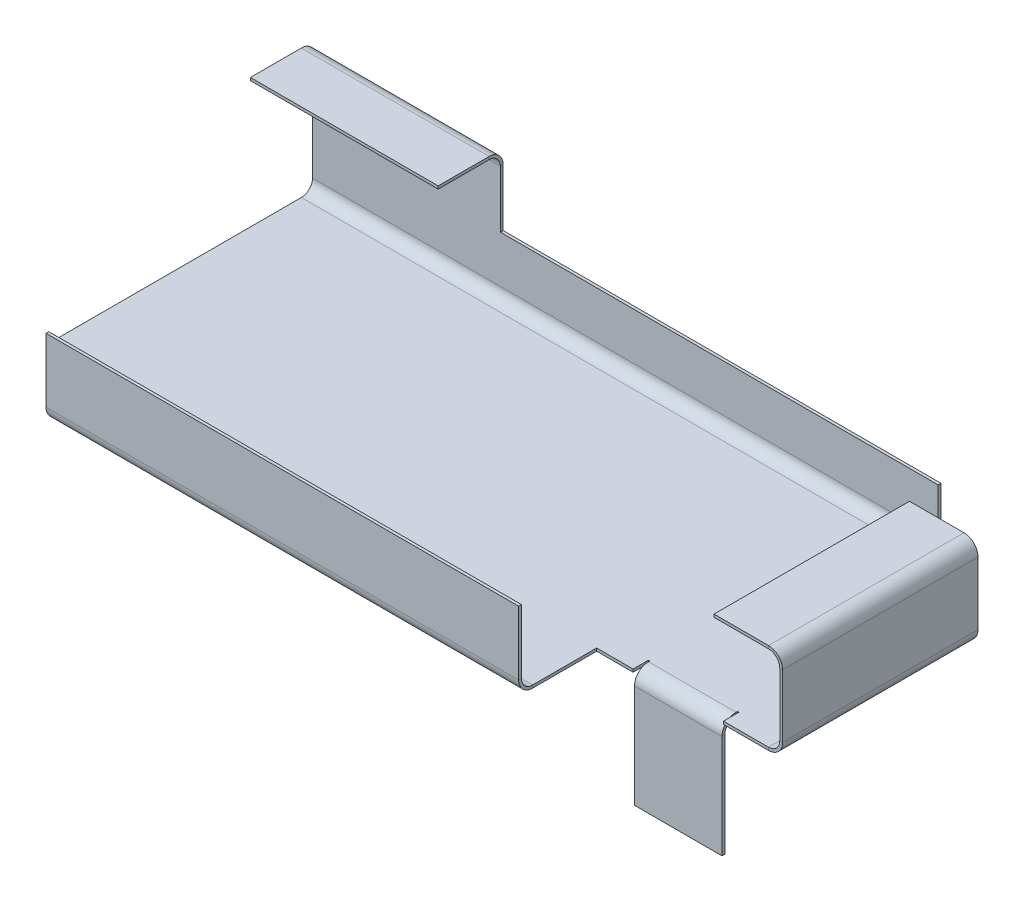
ISO-10303-21;
HEADER;
FILE_DESCRIPTION(('STEP AP214'),'2;1');
FILE_NAME('part.step','',(''),(''),'','','');
FILE_SCHEMA(('AUTOMOTIVE_DESIGN { 1 0 10303 214 1 1 1 1 }'));
ENDSEC;
DATA;
#1=APPLICATION_CONTEXT('core data for automotive mechanical design processes');
#2=APPLICATION_PROTOCOL_DEFINITION('international standard','automotive_design',2000,#1);
#3=PRODUCT_CONTEXT('',#1,'mechanical');
#4=PRODUCT('Part','Part','',(#3));
#5=PRODUCT_RELATED_PRODUCT_CATEGORY('part','',(#4));
#6=PRODUCT_DEFINITION_FORMATION('','',#4);
#7=PRODUCT_DEFINITION_CONTEXT('part definition',#1,'design');
#8=PRODUCT_DEFINITION('design','',#6,#7);
#9=PRODUCT_DEFINITION_SHAPE('','',#8);
#10=(LENGTH_UNIT() NAMED_UNIT(*) SI_UNIT(.MILLI.,.METRE.));
#11=(NAMED_UNIT(*) PLANE_ANGLE_UNIT() SI_UNIT($,.RADIAN.));
#12=(NAMED_UNIT(*) SI_UNIT($,.STERADIAN.) SOLID_ANGLE_UNIT());
#13=UNCERTAINTY_MEASURE_WITH_UNIT(LENGTH_MEASURE(1.E-05),#10,'distance_accuracy_value','');
#14=(GEOMETRIC_REPRESENTATION_CONTEXT(3) GLOBAL_UNCERTAINTY_ASSIGNED_CONTEXT((#13)) GLOBAL_UNIT_ASSIGNED_CONTEXT((#10,
#11,#12)) REPRESENTATION_CONTEXT('',''));
#15=CARTESIAN_POINT('',(0.,0.,0.));
#16=DIRECTION('',(0.,0.,1.));
#17=DIRECTION('',(1.,0.,0.));
#18=AXIS2_PLACEMENT_3D('',#15,#16,#17);
#19=CARTESIAN_POINT('',(102.619545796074,-20.4197597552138,-48.2719283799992));
#20=DIRECTION('',(0.,-1.,0.));
#21=DIRECTION('',(0.,0.,-1.));
#22=AXIS2_PLACEMENT_3D('',#19,#20,#21);
#23=PLANE('',#22);
#24=DIRECTION('',(1.,0.,0.));
#25=VECTOR('',#24,1.);
#26=CARTESIAN_POINT('',(102.619545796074,-20.4197597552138,0.));
#27=LINE('',#26,#25);
#28=CARTESIAN_POINT('',(102.619545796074,-20.4197597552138,0.));
#29=VERTEX_POINT('',#28);
#30=CARTESIAN_POINT('',(118.216251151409,-20.4197597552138,0.));
#31=VERTEX_POINT('',#30);
#32=EDGE_CURVE('E433',#29,#31,#27,.T.);
#33=ORIENTED_EDGE('',*,*,#32,.F.);
#34=DIRECTION('',(0.,0.,1.));
#35=VECTOR('',#34,1.);
#36=CARTESIAN_POINT('',(102.619545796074,-20.4197597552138,-48.2719283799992));
#37=LINE('',#36,#35);
#38=CARTESIAN_POINT('',(102.619545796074,-20.4197597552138,-0.499999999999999));
#39=VERTEX_POINT('',#38);
#40=EDGE_CURVE('E51',#39,#29,#37,.T.);
#41=ORIENTED_EDGE('',*,*,#40,.F.);
#42=DIRECTION('',(1.,0.,0.));
#43=VECTOR('',#42,1.);
#44=CARTESIAN_POINT('',(102.619545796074,-20.4197597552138,-0.5));
#45=LINE('',#44,#43);
#46=CARTESIAN_POINT('',(118.216251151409,-20.4197597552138,-0.499999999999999));
#47=VERTEX_POINT('',#46);
#48=EDGE_CURVE('E72',#39,#47,#45,.T.);
#49=ORIENTED_EDGE('',*,*,#48,.T.);
#50=DIRECTION('',(0.,0.,1.));
#51=VECTOR('',#50,1.);
#52=CARTESIAN_POINT('',(118.216251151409,-20.4197597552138,-48.2719283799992));
#53=LINE('',#52,#51);
#54=EDGE_CURVE('E427',#47,#31,#53,.T.);
#55=ORIENTED_EDGE('',*,*,#54,.T.);
#56=EDGE_LOOP('',(#33,#41,#49,#55));
#57=FACE_BOUND('',#56,.T.);
#58=ADVANCED_FACE('F32',(#57),#23,.T.);
#59=CARTESIAN_POINT('',(118.216251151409,0.5,-48.2719283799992));
#60=DIRECTION('',(1.,0.,0.));
#61=DIRECTION('',(0.,1.,0.));
#62=AXIS2_PLACEMENT_3D('',#59,#60,#61);
#63=PLANE('',#62);
#64=DIRECTION('',(0.,1.,0.));
#65=VECTOR('',#64,1.);
#66=CARTESIAN_POINT('',(118.216251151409,0.5,0.));
#67=LINE('',#66,#65);
#68=CARTESIAN_POINT('',(118.216251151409,-2.,0.));
#69=VERTEX_POINT('',#68);
#70=EDGE_CURVE('E66',#31,#69,#67,.T.);
#71=ORIENTED_EDGE('',*,*,#70,.F.);
#72=ORIENTED_EDGE('',*,*,#54,.F.);
#73=DIRECTION('',(0.,1.,0.));
#74=VECTOR('',#73,1.);
#75=CARTESIAN_POINT('',(118.216251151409,0.5,-0.5));
#76=LINE('',#75,#74);
#77=CARTESIAN_POINT('',(118.216251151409,-2.,-0.5));
#78=VERTEX_POINT('',#77);
#79=EDGE_CURVE('E415',#47,#78,#76,.T.);
#80=ORIENTED_EDGE('',*,*,#79,.T.);
#81=DIRECTION('',(0.,0.,1.));
#82=VECTOR('',#81,1.);
#83=CARTESIAN_POINT('',(118.216251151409,-2.,-48.2719283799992));
#84=LINE('',#83,#82);
#85=EDGE_CURVE('E407',#78,#69,#84,.T.);
#86=ORIENTED_EDGE('',*,*,#85,.T.);
#87=EDGE_LOOP('',(#71,#72,#80,#86));
#88=FACE_BOUND('',#87,.T.);
#89=ADVANCED_FACE('F426',(#88),#63,.T.);
#90=CARTESIAN_POINT('',(155.286571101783,0.5,0.));
#91=DIRECTION('',(0.,0.,-1.));
#92=DIRECTION('',(-1.,0.,0.));
#93=AXIS2_PLACEMENT_3D('',#90,#91,#92);
#94=PLANE('',#93);
#95=ORIENTED_EDGE('',*,*,#70,.T.);
#96=DIRECTION('',(-1.,0.,0.));
#97=VECTOR('',#96,1.);
#98=CARTESIAN_POINT('',(118.216251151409,-2.,0.));
#99=LINE('',#98,#97);
#100=CARTESIAN_POINT('',(102.619545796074,-2.,0.));
#101=VERTEX_POINT('',#100);
#102=EDGE_CURVE('E442',#69,#101,#99,.T.);
#103=ORIENTED_EDGE('',*,*,#102,.T.);
#104=DIRECTION('',(0.,-1.,0.));
#105=VECTOR('',#104,1.);
#106=CARTESIAN_POINT('',(102.619545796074,0.5,0.));
#107=LINE('',#106,#105);
#108=EDGE_CURVE('E439',#101,#29,#107,.T.);
#109=ORIENTED_EDGE('',*,*,#108,.T.);
#110=ORIENTED_EDGE('',*,*,#32,.T.);
#111=EDGE_LOOP('',(#95,#103,#109,#110));
#112=FACE_BOUND('',#111,.T.);
#113=ADVANCED_FACE('F761',(#112),#94,.F.);
#114=CARTESIAN_POINT('',(102.619545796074,0.5,-48.2719283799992));
#115=DIRECTION('',(-1.,0.,0.));
#116=DIRECTION('',(0.,-1.,0.));
#117=AXIS2_PLACEMENT_3D('',#114,#115,#116);
#118=PLANE('',#117);
#119=ORIENTED_EDGE('',*,*,#108,.F.);
#120=DIRECTION('',(0.,0.,1.));
#121=VECTOR('',#120,1.);
#122=CARTESIAN_POINT('',(102.619545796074,-2.,-48.2719283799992));
#123=LINE('',#122,#121);
#124=CARTESIAN_POINT('',(102.619545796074,-2.,-0.5));
#125=VERTEX_POINT('',#124);
#126=EDGE_CURVE('E36',#125,#101,#123,.T.);
#127=ORIENTED_EDGE('',*,*,#126,.F.);
#128=DIRECTION('',(0.,1.,0.));
#129=VECTOR('',#128,1.);
#130=CARTESIAN_POINT('',(102.619545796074,0.5,-0.5));
#131=LINE('',#130,#129);
#132=EDGE_CURVE('E42',#39,#125,#131,.T.);
#133=ORIENTED_EDGE('',*,*,#132,.F.);
#134=ORIENTED_EDGE('',*,*,#40,.T.);
#135=EDGE_LOOP('',(#119,#127,#133,#134));
#136=FACE_BOUND('',#135,.T.);
#137=ADVANCED_FACE('F768',(#136),#118,.T.);
#138=CARTESIAN_POINT('',(102.619545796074,-20.4197597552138,-0.5));
#139=DIRECTION('',(0.,0.,1.));
#140=DIRECTION('',(1.,0.,0.));
#141=AXIS2_PLACEMENT_3D('',#138,#139,#140);
#142=PLANE('',#141);
#143=ORIENTED_EDGE('',*,*,#132,.T.);
#144=DIRECTION('',(1.,0.,0.));
#145=VECTOR('',#144,1.);
#146=CARTESIAN_POINT('',(118.216251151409,-2.,-0.5));
#147=LINE('',#146,#145);
#148=EDGE_CURVE('E11',#125,#78,#147,.T.);
#149=ORIENTED_EDGE('',*,*,#148,.T.);
#150=ORIENTED_EDGE('',*,*,#79,.F.);
#151=ORIENTED_EDGE('',*,*,#48,.F.);
#152=EDGE_LOOP('',(#143,#149,#150,#151));
#153=FACE_BOUND('',#152,.T.);
#154=ADVANCED_FACE('F34',(#153),#142,.F.);
#155=CARTESIAN_POINT('',(3.25075890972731E-13,398.506545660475,-34.147586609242));
#156=DIRECTION('',(0.,0.,1.));
#157=DIRECTION('',(-1.,0.,0.));
#158=AXIS2_PLACEMENT_3D('',#155,#156,#157);
#159=PLANE('',#158);
#160=DIRECTION('',(-1.,0.,0.));
#161=VECTOR('',#160,1.);
#162=CARTESIAN_POINT('',(0.,23.0722171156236,-34.1475866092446));
#163=LINE('',#162,#161);
#164=CARTESIAN_POINT('',(33.4756358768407,23.0722171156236,-34.1475866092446));
#165=VERTEX_POINT('',#164);
#166=CARTESIAN_POINT('',(0.,23.0722171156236,-34.1475866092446));
#167=VERTEX_POINT('',#166);
#168=EDGE_CURVE('E461',#165,#167,#163,.T.);
#169=ORIENTED_EDGE('',*,*,#168,.F.);
#170=DIRECTION('',(0.,-1.,0.));
#171=VECTOR('',#170,1.);
#172=CARTESIAN_POINT('',(33.475635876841,398.506545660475,-34.147586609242));
#173=LINE('',#172,#171);
#174=CARTESIAN_POINT('',(33.4756358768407,23.5722171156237,-34.1475866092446));
#175=VERTEX_POINT('',#174);
#176=EDGE_CURVE('E447',#175,#165,#173,.T.);
#177=ORIENTED_EDGE('',*,*,#176,.F.);
#178=DIRECTION('',(-1.,0.,0.));
#179=VECTOR('',#178,1.);
#180=CARTESIAN_POINT('',(0.,23.5722171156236,-34.1475866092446));
#181=LINE('',#180,#179);
#182=CARTESIAN_POINT('',(0.,23.5722171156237,-34.1475866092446));
#183=VERTEX_POINT('',#182);
#184=EDGE_CURVE('E95',#175,#183,#181,.T.);
#185=ORIENTED_EDGE('',*,*,#184,.T.);
#186=DIRECTION('',(0.,-1.,0.));
#187=VECTOR('',#186,1.);
#188=CARTESIAN_POINT('',(3.25075890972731E-13,398.506545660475,-34.147586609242));
#189=LINE('',#188,#187);
#190=EDGE_CURVE('E474',#183,#167,#189,.T.);
#191=ORIENTED_EDGE('',*,*,#190,.T.);
#192=EDGE_LOOP('',(#169,#177,#185,#191));
#193=FACE_BOUND('',#192,.T.);
#194=ADVANCED_FACE('F774',(#193),#159,.T.);
#195=CARTESIAN_POINT('',(0.,23.5722171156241,-112.880786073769));
#196=DIRECTION('',(0.,1.,0.));
#197=DIRECTION('',(0.,0.,1.));
#198=AXIS2_PLACEMENT_3D('',#195,#196,#197);
#199=PLANE('',#198);
#200=DIRECTION('',(0.,0.,1.));
#201=VECTOR('',#200,1.);
#202=CARTESIAN_POINT('',(33.4756358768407,23.5722171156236,-34.1475866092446));
#203=LINE('',#202,#201);
#204=CARTESIAN_POINT('',(33.4756358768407,23.5722171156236,-43.2272936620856));
#205=VERTEX_POINT('',#204);
#206=EDGE_CURVE('E80',#205,#175,#203,.T.);
#207=ORIENTED_EDGE('',*,*,#206,.F.);
#208=DIRECTION('',(-1.,0.,0.));
#209=VECTOR('',#208,1.);
#210=CARTESIAN_POINT('',(0.,23.5722171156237,-43.2272936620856));
#211=LINE('',#210,#209);
#212=CARTESIAN_POINT('',(0.,23.5722171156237,-43.2272936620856));
#213=VERTEX_POINT('',#212);
#214=EDGE_CURVE('E471',#205,#213,#211,.T.);
#215=ORIENTED_EDGE('',*,*,#214,.T.);
#216=DIRECTION('',(0.,0.,-1.));
#217=VECTOR('',#216,1.);
#218=CARTESIAN_POINT('',(0.,23.5722171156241,-112.880786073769));
#219=LINE('',#218,#217);
#220=EDGE_CURVE('E468',#183,#213,#219,.T.);
#221=ORIENTED_EDGE('',*,*,#220,.F.);
#222=ORIENTED_EDGE('',*,*,#184,.F.);
#223=EDGE_LOOP('',(#207,#215,#221,#222));
#224=FACE_BOUND('',#223,.T.);
#225=ADVANCED_FACE('F1018',(#224),#199,.T.);
#226=CARTESIAN_POINT('',(3.95253913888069E-13,398.506545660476,-112.880786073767));
#227=DIRECTION('',(-1.,0.,0.));
#228=DIRECTION('',(0.,0.,-1.));
#229=AXIS2_PLACEMENT_3D('',#226,#227,#228);
#230=PLANE('',#229);
#231=ORIENTED_EDGE('',*,*,#220,.T.);
#232=DIRECTION('',(0.,-1.,0.));
#233=VECTOR('',#232,1.);
#234=CARTESIAN_POINT('',(3.33168993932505E-13,398.506545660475,-43.227293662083));
#235=LINE('',#234,#233);
#236=CARTESIAN_POINT('',(0.,23.0722171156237,-43.2272936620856));
#237=VERTEX_POINT('',#236);
#238=EDGE_CURVE('E465',#213,#237,#235,.T.);
#239=ORIENTED_EDGE('',*,*,#238,.T.);
#240=DIRECTION('',(0.,0.,-1.));
#241=VECTOR('',#240,1.);
#242=CARTESIAN_POINT('',(0.,23.0722171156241,-112.880786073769));
#243=LINE('',#242,#241);
#244=EDGE_CURVE('E458',#167,#237,#243,.T.);
#245=ORIENTED_EDGE('',*,*,#244,.F.);
#246=ORIENTED_EDGE('',*,*,#190,.F.);
#247=EDGE_LOOP('',(#231,#239,#245,#246));
#248=FACE_BOUND('',#247,.T.);
#249=ADVANCED_FACE('F1021',(#248),#230,.T.);
#250=CARTESIAN_POINT('',(0.,23.0722171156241,-112.880786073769));
#251=DIRECTION('',(0.,1.,0.));
#252=DIRECTION('',(0.,0.,1.));
#253=AXIS2_PLACEMENT_3D('',#250,#251,#252);
#254=PLANE('',#253);
#255=DIRECTION('',(-1.,0.,0.));
#256=VECTOR('',#255,1.);
#257=CARTESIAN_POINT('',(0.,23.0722171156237,-43.2272936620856));
#258=LINE('',#257,#256);
#259=CARTESIAN_POINT('',(33.4756358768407,23.0722171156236,-43.2272936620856));
#260=VERTEX_POINT('',#259);
#261=EDGE_CURVE('E476',#260,#237,#258,.T.);
#262=ORIENTED_EDGE('',*,*,#261,.F.);
#263=DIRECTION('',(0.,0.,1.));
#264=VECTOR('',#263,1.);
#265=CARTESIAN_POINT('',(33.4756358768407,23.0722171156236,-34.1475866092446));
#266=LINE('',#265,#264);
#267=EDGE_CURVE('E463',#260,#165,#266,.T.);
#268=ORIENTED_EDGE('',*,*,#267,.T.);
#269=ORIENTED_EDGE('',*,*,#168,.T.);
#270=ORIENTED_EDGE('',*,*,#244,.T.);
#271=EDGE_LOOP('',(#262,#268,#269,#270));
#272=FACE_BOUND('',#271,.T.);
#273=ADVANCED_FACE('F1024',(#272),#254,.F.);
#274=CARTESIAN_POINT('',(33.475635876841,398.506545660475,-34.147586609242));
#275=DIRECTION('',(1.,0.,0.));
#276=DIRECTION('',(0.,0.,1.));
#277=AXIS2_PLACEMENT_3D('',#274,#275,#276);
#278=PLANE('',#277);
#279=ORIENTED_EDGE('',*,*,#267,.F.);
#280=DIRECTION('',(0.,1.,0.));
#281=VECTOR('',#280,1.);
#282=CARTESIAN_POINT('',(33.475635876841,398.506545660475,-43.227293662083));
#283=LINE('',#282,#281);
#284=EDGE_CURVE('E451',#260,#205,#283,.T.);
#285=ORIENTED_EDGE('',*,*,#284,.T.);
#286=ORIENTED_EDGE('',*,*,#206,.T.);
#287=ORIENTED_EDGE('',*,*,#176,.T.);
#288=EDGE_LOOP('',(#279,#285,#286,#287));
#289=FACE_BOUND('',#288,.T.);
#290=ADVANCED_FACE('F764',(#289),#278,.T.);
#291=CARTESIAN_POINT('',(95.8725786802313,13.9046528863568,388.838981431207));
#292=DIRECTION('',(0.,1.,0.));
#293=DIRECTION('',(1.,0.,0.));
#294=AXIS2_PLACEMENT_3D('',#291,#292,#293);
#295=PLANE('',#294);
#296=DIRECTION('',(1.,0.,0.));
#297=VECTOR('',#296,1.);
#298=CARTESIAN_POINT('',(95.8725786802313,13.9046528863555,13.4046528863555));
#299=LINE('',#298,#297);
#300=CARTESIAN_POINT('',(11.6127348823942,13.9046528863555,13.4046528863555));
#301=VERTEX_POINT('',#300);
#302=CARTESIAN_POINT('',(95.8725786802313,13.9046528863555,13.4046528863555));
#303=VERTEX_POINT('',#302);
#304=EDGE_CURVE('E493',#301,#303,#299,.T.);
#305=ORIENTED_EDGE('',*,*,#304,.F.);
#306=DIRECTION('',(0.,0.,-1.));
#307=VECTOR('',#306,1.);
#308=CARTESIAN_POINT('',(11.6127348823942,13.9046528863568,388.838981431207));
#309=LINE('',#308,#307);
#310=CARTESIAN_POINT('',(11.6127348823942,13.9046528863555,13.9046528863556));
#311=VERTEX_POINT('',#310);
#312=EDGE_CURVE('E477',#311,#301,#309,.T.);
#313=ORIENTED_EDGE('',*,*,#312,.F.);
#314=DIRECTION('',(1.,0.,0.));
#315=VECTOR('',#314,1.);
#316=CARTESIAN_POINT('',(95.8725786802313,13.9046528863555,13.9046528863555));
#317=LINE('',#316,#315);
#318=CARTESIAN_POINT('',(95.8725786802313,13.9046528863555,13.9046528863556));
#319=VERTEX_POINT('',#318);
#320=EDGE_CURVE('E135',#311,#319,#317,.T.);
#321=ORIENTED_EDGE('',*,*,#320,.T.);
#322=DIRECTION('',(0.,0.,-1.));
#323=VECTOR('',#322,1.);
#324=CARTESIAN_POINT('',(95.8725786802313,13.9046528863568,388.838981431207));
#325=LINE('',#324,#323);
#326=EDGE_CURVE('E506',#319,#303,#325,.T.);
#327=ORIENTED_EDGE('',*,*,#326,.T.);
#328=EDGE_LOOP('',(#305,#313,#321,#327));
#329=FACE_BOUND('',#328,.T.);
#330=ADVANCED_FACE('F995',(#329),#295,.T.);
#331=CARTESIAN_POINT('',(0.,-12.8316437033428,13.9046528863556));
#332=DIRECTION('',(0.,0.,1.));
#333=DIRECTION('',(0.,-1.,0.));
#334=AXIS2_PLACEMENT_3D('',#331,#332,#333);
#335=PLANE('',#334);
#336=DIRECTION('',(0.,1.,0.));
#337=VECTOR('',#336,1.);
#338=CARTESIAN_POINT('',(11.6127348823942,13.9046528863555,13.9046528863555));
#339=LINE('',#338,#337);
#340=CARTESIAN_POINT('',(11.6127348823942,2.50000000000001,13.9046528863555));
#341=VERTEX_POINT('',#340);
#342=EDGE_CURVE('E112',#341,#311,#339,.T.);
#343=ORIENTED_EDGE('',*,*,#342,.F.);
#344=DIRECTION('',(1.,0.,0.));
#345=VECTOR('',#344,1.);
#346=CARTESIAN_POINT('',(0.,2.50000000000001,13.9046528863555));
#347=LINE('',#346,#345);
#348=CARTESIAN_POINT('',(95.8725786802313,2.50000000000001,13.9046528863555));
#349=VERTEX_POINT('',#348);
#350=EDGE_CURVE('E503',#341,#349,#347,.T.);
#351=ORIENTED_EDGE('',*,*,#350,.T.);
#352=DIRECTION('',(0.,-1.,0.));
#353=VECTOR('',#352,1.);
#354=CARTESIAN_POINT('',(95.8725786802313,-12.8316437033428,13.9046528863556));
#355=LINE('',#354,#353);
#356=EDGE_CURVE('E500',#319,#349,#355,.T.);
#357=ORIENTED_EDGE('',*,*,#356,.F.);
#358=ORIENTED_EDGE('',*,*,#320,.F.);
#359=EDGE_LOOP('',(#343,#351,#357,#358));
#360=FACE_BOUND('',#359,.T.);
#361=ADVANCED_FACE('F998',(#360),#335,.T.);
#362=CARTESIAN_POINT('',(95.8725786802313,-12.8316437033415,388.838981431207));
#363=DIRECTION('',(1.,0.,0.));
#364=DIRECTION('',(0.,-1.,0.));
#365=AXIS2_PLACEMENT_3D('',#362,#363,#364);
#366=PLANE('',#365);
#367=ORIENTED_EDGE('',*,*,#356,.T.);
#368=DIRECTION('',(0.,0.,-1.));
#369=VECTOR('',#368,1.);
#370=CARTESIAN_POINT('',(95.8725786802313,2.50000000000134,388.838981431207));
#371=LINE('',#370,#369);
#372=CARTESIAN_POINT('',(95.8725786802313,2.50000000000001,13.4046528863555));
#373=VERTEX_POINT('',#372);
#374=EDGE_CURVE('E497',#349,#373,#371,.T.);
#375=ORIENTED_EDGE('',*,*,#374,.T.);
#376=DIRECTION('',(0.,-1.,0.));
#377=VECTOR('',#376,1.);
#378=CARTESIAN_POINT('',(95.8725786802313,-12.8316437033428,13.4046528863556));
#379=LINE('',#378,#377);
#380=EDGE_CURVE('E490',#303,#373,#379,.T.);
#381=ORIENTED_EDGE('',*,*,#380,.F.);
#382=ORIENTED_EDGE('',*,*,#326,.F.);
#383=EDGE_LOOP('',(#367,#375,#381,#382));
#384=FACE_BOUND('',#383,.T.);
#385=ADVANCED_FACE('F1001',(#384),#366,.T.);
#386=CARTESIAN_POINT('',(0.,-12.8316437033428,13.4046528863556));
#387=DIRECTION('',(0.,0.,1.));
#388=DIRECTION('',(0.,-1.,0.));
#389=AXIS2_PLACEMENT_3D('',#386,#387,#388);
#390=PLANE('',#389);
#391=DIRECTION('',(1.,0.,0.));
#392=VECTOR('',#391,1.);
#393=CARTESIAN_POINT('',(0.,2.50000000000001,13.4046528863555));
#394=LINE('',#393,#392);
#395=CARTESIAN_POINT('',(11.6127348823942,2.50000000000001,13.4046528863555));
#396=VERTEX_POINT('',#395);
#397=EDGE_CURVE('E509',#396,#373,#394,.T.);
#398=ORIENTED_EDGE('',*,*,#397,.F.);
#399=DIRECTION('',(0.,1.,0.));
#400=VECTOR('',#399,1.);
#401=CARTESIAN_POINT('',(11.6127348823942,13.9046528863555,13.4046528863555));
#402=LINE('',#401,#400);
#403=EDGE_CURVE('E495',#396,#301,#402,.T.);
#404=ORIENTED_EDGE('',*,*,#403,.T.);
#405=ORIENTED_EDGE('',*,*,#304,.T.);
#406=ORIENTED_EDGE('',*,*,#380,.T.);
#407=EDGE_LOOP('',(#398,#404,#405,#406));
#408=FACE_BOUND('',#407,.T.);
#409=ADVANCED_FACE('F1005',(#408),#390,.F.);
#410=CARTESIAN_POINT('',(11.6127348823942,13.9046528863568,388.838981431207));
#411=DIRECTION('',(-1.,0.,0.));
#412=DIRECTION('',(0.,1.,0.));
#413=AXIS2_PLACEMENT_3D('',#410,#411,#412);
#414=PLANE('',#413);
#415=ORIENTED_EDGE('',*,*,#403,.F.);
#416=DIRECTION('',(0.,0.,1.));
#417=VECTOR('',#416,1.);
#418=CARTESIAN_POINT('',(11.6127348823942,2.50000000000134,388.838981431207));
#419=LINE('',#418,#417);
#420=EDGE_CURVE('E483',#396,#341,#419,.T.);
#421=ORIENTED_EDGE('',*,*,#420,.T.);
#422=ORIENTED_EDGE('',*,*,#342,.T.);
#423=ORIENTED_EDGE('',*,*,#312,.T.);
#424=EDGE_LOOP('',(#415,#421,#422,#423));
#425=FACE_BOUND('',#424,.T.);
#426=ADVANCED_FACE('F978',(#425),#414,.T.);
#427=CARTESIAN_POINT('',(116.793734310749,391.128911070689,-34.8382046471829));
#428=DIRECTION('',(-1.,0.,0.));
#429=DIRECTION('',(0.,0.,-1.));
#430=AXIS2_PLACEMENT_3D('',#427,#428,#429);
#431=PLANE('',#430);
#432=DIRECTION('',(0.,0.,-1.));
#433=VECTOR('',#432,1.);
#434=CARTESIAN_POINT('',(116.793734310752,15.6945825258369,-34.8382046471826));
#435=LINE('',#434,#433);
#436=CARTESIAN_POINT('',(116.793734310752,15.6945825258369,0.));
#437=VERTEX_POINT('',#436);
#438=CARTESIAN_POINT('',(116.793734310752,15.6945825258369,-34.8382046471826));
#439=VERTEX_POINT('',#438);
#440=EDGE_CURVE('E598',#437,#439,#435,.T.);
#441=ORIENTED_EDGE('',*,*,#440,.F.);
#442=DIRECTION('',(0.,-1.,0.));
#443=VECTOR('',#442,1.);
#444=CARTESIAN_POINT('',(116.793734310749,391.128911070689,-2.89827439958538E-13));
#445=LINE('',#444,#443);
#446=CARTESIAN_POINT('',(116.793734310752,16.194582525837,0.));
#447=VERTEX_POINT('',#446);
#448=EDGE_CURVE('E511',#447,#437,#445,.T.);
#449=ORIENTED_EDGE('',*,*,#448,.F.);
#450=DIRECTION('',(0.,0.,-1.));
#451=VECTOR('',#450,1.);
#452=CARTESIAN_POINT('',(116.793734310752,16.1945825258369,-34.8382046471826));
#453=LINE('',#452,#451);
#454=CARTESIAN_POINT('',(116.793734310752,16.194582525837,-34.8382046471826));
#455=VERTEX_POINT('',#454);
#456=EDGE_CURVE('E159',#447,#455,#453,.T.);
#457=ORIENTED_EDGE('',*,*,#456,.T.);
#458=DIRECTION('',(0.,-1.,0.));
#459=VECTOR('',#458,1.);
#460=CARTESIAN_POINT('',(116.793734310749,391.128911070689,-34.8382046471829));
#461=LINE('',#460,#459);
#462=EDGE_CURVE('E611',#455,#439,#461,.T.);
#463=ORIENTED_EDGE('',*,*,#462,.T.);
#464=EDGE_LOOP('',(#441,#449,#457,#463));
#465=FACE_BOUND('',#464,.T.);
#466=ADVANCED_FACE('F881',(#465),#431,.T.);
#467=CARTESIAN_POINT('',(272.080305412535,16.194582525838,-1.14834210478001E-13));
#468=DIRECTION('',(0.,1.,0.));
#469=DIRECTION('',(0.,0.,-1.));
#470=AXIS2_PLACEMENT_3D('',#467,#468,#469);
#471=PLANE('',#470);
#472=DIRECTION('',(-1.,0.,0.));
#473=VECTOR('',#472,1.);
#474=CARTESIAN_POINT('',(116.793734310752,16.1945825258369,0.));
#475=LINE('',#474,#473);
#476=CARTESIAN_POINT('',(126.515870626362,16.194582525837,0.));
#477=VERTEX_POINT('',#476);
#478=EDGE_CURVE('E144',#477,#447,#475,.T.);
#479=ORIENTED_EDGE('',*,*,#478,.F.);
#480=DIRECTION('',(0.,0.,-1.));
#481=VECTOR('',#480,1.);
#482=CARTESIAN_POINT('',(126.515870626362,16.194582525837,-1.14834210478E-13));
#483=LINE('',#482,#481);
#484=CARTESIAN_POINT('',(126.515870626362,16.194582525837,-34.8382046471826));
#485=VERTEX_POINT('',#484);
#486=EDGE_CURVE('E608',#477,#485,#483,.T.);
#487=ORIENTED_EDGE('',*,*,#486,.T.);
#488=DIRECTION('',(1.,0.,0.));
#489=VECTOR('',#488,1.);
#490=CARTESIAN_POINT('',(160.544037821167,16.1945825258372,-34.8382046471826));
#491=LINE('',#490,#489);
#492=EDGE_CURVE('E605',#455,#485,#491,.T.);
#493=ORIENTED_EDGE('',*,*,#492,.F.);
#494=ORIENTED_EDGE('',*,*,#456,.F.);
#495=EDGE_LOOP('',(#479,#487,#493,#494));
#496=FACE_BOUND('',#495,.T.);
#497=ADVANCED_FACE('F885',(#496),#471,.T.);
#498=CARTESIAN_POINT('',(160.544037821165,391.128911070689,-34.8382046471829));
#499=DIRECTION('',(0.,0.,-1.));
#500=DIRECTION('',(1.,0.,0.));
#501=AXIS2_PLACEMENT_3D('',#498,#499,#500);
#502=PLANE('',#501);
#503=ORIENTED_EDGE('',*,*,#492,.T.);
#504=DIRECTION('',(0.,-1.,0.));
#505=VECTOR('',#504,1.);
#506=CARTESIAN_POINT('',(126.515870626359,391.128911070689,-34.8382046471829));
#507=LINE('',#506,#505);
#508=CARTESIAN_POINT('',(126.515870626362,15.694582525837,-34.8382046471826));
#509=VERTEX_POINT('',#508);
#510=EDGE_CURVE('E602',#485,#509,#507,.T.);
#511=ORIENTED_EDGE('',*,*,#510,.T.);
#512=DIRECTION('',(1.,0.,0.));
#513=VECTOR('',#512,1.);
#514=CARTESIAN_POINT('',(160.544037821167,15.6945825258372,-34.8382046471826));
#515=LINE('',#514,#513);
#516=EDGE_CURVE('E595',#439,#509,#515,.T.);
#517=ORIENTED_EDGE('',*,*,#516,.F.);
#518=ORIENTED_EDGE('',*,*,#462,.F.);
#519=EDGE_LOOP('',(#503,#511,#517,#518));
#520=FACE_BOUND('',#519,.T.);
#521=ADVANCED_FACE('F877',(#520),#502,.T.);
#522=CARTESIAN_POINT('',(272.080305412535,15.694582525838,-1.14435860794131E-13));
#523=DIRECTION('',(0.,1.,0.));
#524=DIRECTION('',(0.,0.,-1.));
#525=AXIS2_PLACEMENT_3D('',#522,#523,#524);
#526=PLANE('',#525);
#527=DIRECTION('',(0.,0.,-1.));
#528=VECTOR('',#527,1.);
#529=CARTESIAN_POINT('',(126.515870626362,15.694582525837,-1.1443586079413E-13));
#530=LINE('',#529,#528);
#531=CARTESIAN_POINT('',(126.515870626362,15.694582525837,0.));
#532=VERTEX_POINT('',#531);
#533=EDGE_CURVE('E586',#532,#509,#530,.T.);
#534=ORIENTED_EDGE('',*,*,#533,.F.);
#535=DIRECTION('',(-1.,0.,0.));
#536=VECTOR('',#535,1.);
#537=CARTESIAN_POINT('',(116.793734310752,15.6945825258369,0.));
#538=LINE('',#537,#536);
#539=EDGE_CURVE('E600',#532,#437,#538,.T.);
#540=ORIENTED_EDGE('',*,*,#539,.T.);
#541=ORIENTED_EDGE('',*,*,#440,.T.);
#542=ORIENTED_EDGE('',*,*,#516,.T.);
#543=EDGE_LOOP('',(#534,#540,#541,#542));
#544=FACE_BOUND('',#543,.T.);
#545=ADVANCED_FACE('F879',(#544),#526,.F.);
#546=CARTESIAN_POINT('',(116.793734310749,391.128911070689,-2.89827439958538E-13));
#547=DIRECTION('',(0.,0.,1.));
#548=DIRECTION('',(-1.,0.,0.));
#549=AXIS2_PLACEMENT_3D('',#546,#547,#548);
#550=PLANE('',#549);
#551=ORIENTED_EDGE('',*,*,#539,.F.);
#552=DIRECTION('',(0.,1.,0.));
#553=VECTOR('',#552,1.);
#554=CARTESIAN_POINT('',(126.515870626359,391.128911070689,-2.97573059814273E-13));
#555=LINE('',#554,#553);
#556=EDGE_CURVE('E593',#532,#477,#555,.T.);
#557=ORIENTED_EDGE('',*,*,#556,.T.);
#558=ORIENTED_EDGE('',*,*,#478,.T.);
#559=ORIENTED_EDGE('',*,*,#448,.T.);
#560=EDGE_LOOP('',(#551,#557,#558,#559));
#561=FACE_BOUND('',#560,.T.);
#562=ADVANCED_FACE('F882',(#561),#550,.T.);
#563=CARTESIAN_POINT('',(129.015870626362,-127.942861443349,0.));
#564=DIRECTION('',(1.,0.,0.));
#565=DIRECTION('',(0.,0.,-1.));
#566=AXIS2_PLACEMENT_3D('',#563,#564,#565);
#567=PLANE('',#566);
#568=DIRECTION('',(0.,0.,-1.));
#569=VECTOR('',#568,1.);
#570=CARTESIAN_POINT('',(129.015870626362,13.694582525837,-1.12842462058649E-13));
#571=LINE('',#570,#569);
#572=CARTESIAN_POINT('',(129.015870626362,13.694582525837,0.));
#573=VERTEX_POINT('',#572);
#574=CARTESIAN_POINT('',(129.015870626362,13.694582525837,-34.8382046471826));
#575=VERTEX_POINT('',#574);
#576=EDGE_CURVE('E195',#573,#575,#571,.T.);
#577=ORIENTED_EDGE('',*,*,#576,.F.);
#578=DIRECTION('',(0.,1.,0.));
#579=VECTOR('',#578,1.);
#580=CARTESIAN_POINT('',(129.015870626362,27.3437096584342,0.));
#581=LINE('',#580,#579);
#582=CARTESIAN_POINT('',(129.015870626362,2.50000000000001,0.));
#583=VERTEX_POINT('',#582);
#584=EDGE_CURVE('E565',#583,#573,#581,.T.);
#585=ORIENTED_EDGE('',*,*,#584,.F.);
#586=DIRECTION('',(0.,0.,-1.));
#587=VECTOR('',#586,1.);
#588=CARTESIAN_POINT('',(129.015870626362,2.5,0.));
#589=LINE('',#588,#587);
#590=CARTESIAN_POINT('',(129.015870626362,2.50000000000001,-34.8382046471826));
#591=VERTEX_POINT('',#590);
#592=EDGE_CURVE('E575',#583,#591,#589,.T.);
#593=ORIENTED_EDGE('',*,*,#592,.T.);
#594=DIRECTION('',(0.,-1.,0.));
#595=VECTOR('',#594,1.);
#596=CARTESIAN_POINT('',(129.015870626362,-16.4065938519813,-34.8382046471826));
#597=LINE('',#596,#595);
#598=EDGE_CURVE('E574',#575,#591,#597,.T.);
#599=ORIENTED_EDGE('',*,*,#598,.F.);
#600=EDGE_LOOP('',(#577,#585,#593,#599));
#601=FACE_BOUND('',#600,.T.);
#602=ADVANCED_FACE('F857',(#601),#567,.T.);
#603=CARTESIAN_POINT('',(503.950199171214,-16.40659385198,-34.8382046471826));
#604=DIRECTION('',(0.,0.,-1.));
#605=DIRECTION('',(0.,-1.,0.));
#606=AXIS2_PLACEMENT_3D('',#603,#604,#605);
#607=PLANE('',#606);
#608=DIRECTION('',(-1.,0.,0.));
#609=VECTOR('',#608,1.);
#610=CARTESIAN_POINT('',(503.950199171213,13.6945825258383,-34.8382046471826));
#611=LINE('',#610,#609);
#612=CARTESIAN_POINT('',(128.515870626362,13.694582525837,-34.8382046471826));
#613=VERTEX_POINT('',#612);
#614=EDGE_CURVE('E188',#575,#613,#611,.T.);
#615=ORIENTED_EDGE('',*,*,#614,.F.);
#616=ORIENTED_EDGE('',*,*,#598,.T.);
#617=DIRECTION('',(-1.,0.,0.));
#618=VECTOR('',#617,1.);
#619=CARTESIAN_POINT('',(503.950199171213,2.50000000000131,-34.8382046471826));
#620=LINE('',#619,#618);
#621=CARTESIAN_POINT('',(128.515870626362,2.5,-34.8382046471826));
#622=VERTEX_POINT('',#621);
#623=EDGE_CURVE('E571',#591,#622,#620,.T.);
#624=ORIENTED_EDGE('',*,*,#623,.T.);
#625=DIRECTION('',(0.,-1.,0.));
#626=VECTOR('',#625,1.);
#627=CARTESIAN_POINT('',(128.515870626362,-16.4065938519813,-34.8382046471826));
#628=LINE('',#627,#626);
#629=EDGE_CURVE('E566',#613,#622,#628,.T.);
#630=ORIENTED_EDGE('',*,*,#629,.F.);
#631=EDGE_LOOP('',(#615,#616,#624,#630));
#632=FACE_BOUND('',#631,.T.);
#633=ADVANCED_FACE('F862',(#632),#607,.T.);
#634=CARTESIAN_POINT('',(128.515870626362,-127.942861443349,0.));
#635=DIRECTION('',(1.,0.,0.));
#636=DIRECTION('',(0.,0.,-1.));
#637=AXIS2_PLACEMENT_3D('',#634,#635,#636);
#638=PLANE('',#637);
#639=DIRECTION('',(0.,1.,0.));
#640=VECTOR('',#639,1.);
#641=CARTESIAN_POINT('',(128.515870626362,27.3437096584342,0.));
#642=LINE('',#641,#640);
#643=CARTESIAN_POINT('',(128.515870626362,2.50000000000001,0.));
#644=VERTEX_POINT('',#643);
#645=CARTESIAN_POINT('',(128.515870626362,13.694582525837,0.));
#646=VERTEX_POINT('',#645);
#647=EDGE_CURVE('E570',#644,#646,#642,.T.);
#648=ORIENTED_EDGE('',*,*,#647,.T.);
#649=DIRECTION('',(0.,0.,-1.));
#650=VECTOR('',#649,1.);
#651=CARTESIAN_POINT('',(128.515870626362,13.694582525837,-1.12842462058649E-13));
#652=LINE('',#651,#650);
#653=EDGE_CURVE('E567',#646,#613,#652,.T.);
#654=ORIENTED_EDGE('',*,*,#653,.T.);
#655=ORIENTED_EDGE('',*,*,#629,.T.);
#656=DIRECTION('',(0.,0.,-1.));
#657=VECTOR('',#656,1.);
#658=CARTESIAN_POINT('',(128.515870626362,2.5,0.));
#659=LINE('',#658,#657);
#660=EDGE_CURVE('E581',#644,#622,#659,.T.);
#661=ORIENTED_EDGE('',*,*,#660,.F.);
#662=EDGE_LOOP('',(#648,#654,#655,#661));
#663=FACE_BOUND('',#662,.T.);
#664=ADVANCED_FACE('F865',(#663),#638,.F.);
#665=CARTESIAN_POINT('',(503.950199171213,27.3437096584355,0.));
#666=DIRECTION('',(0.,0.,1.));
#667=DIRECTION('',(0.,1.,0.));
#668=AXIS2_PLACEMENT_3D('',#665,#666,#667);
#669=PLANE('',#668);
#670=DIRECTION('',(1.,0.,0.));
#671=VECTOR('',#670,1.);
#672=CARTESIAN_POINT('',(503.950199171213,13.6945825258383,0.));
#673=LINE('',#672,#671);
#674=EDGE_CURVE('E176',#646,#573,#673,.T.);
#675=ORIENTED_EDGE('',*,*,#674,.F.);
#676=ORIENTED_EDGE('',*,*,#647,.F.);
#677=DIRECTION('',(1.,0.,0.));
#678=VECTOR('',#677,1.);
#679=CARTESIAN_POINT('',(503.950199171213,2.50000000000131,0.));
#680=LINE('',#679,#678);
#681=EDGE_CURVE('E562',#644,#583,#680,.T.);
#682=ORIENTED_EDGE('',*,*,#681,.T.);
#683=ORIENTED_EDGE('',*,*,#584,.T.);
#684=EDGE_LOOP('',(#675,#676,#682,#683));
#685=FACE_BOUND('',#684,.T.);
#686=ADVANCED_FACE('F856',(#685),#669,.T.);
#687=CARTESIAN_POINT('',(33.4756358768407,10.8890890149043,-420.661622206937));
#688=DIRECTION('',(0.,1.,0.));
#689=DIRECTION('',(-1.,0.,0.));
#690=AXIS2_PLACEMENT_3D('',#687,#688,#689);
#691=PLANE('',#690);
#692=DIRECTION('',(-1.,0.,0.));
#693=VECTOR('',#692,1.);
#694=CARTESIAN_POINT('',(33.4756358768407,10.889089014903,-45.2272936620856));
#695=LINE('',#694,#693);
#696=CARTESIAN_POINT('',(111.536267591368,10.889089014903,-45.2272936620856));
#697=VERTEX_POINT('',#696);
#698=CARTESIAN_POINT('',(33.4756358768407,10.889089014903,-45.2272936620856));
#699=VERTEX_POINT('',#698);
#700=EDGE_CURVE('E736',#697,#699,#695,.T.);
#701=ORIENTED_EDGE('',*,*,#700,.F.);
#702=DIRECTION('',(0.,0.,1.));
#703=VECTOR('',#702,1.);
#704=CARTESIAN_POINT('',(111.536267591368,10.8890890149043,-420.661622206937));
#705=LINE('',#704,#703);
#706=CARTESIAN_POINT('',(111.536267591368,10.889089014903,-45.7272936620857));
#707=VERTEX_POINT('',#706);
#708=EDGE_CURVE('E584',#707,#697,#705,.T.);
#709=ORIENTED_EDGE('',*,*,#708,.F.);
#710=DIRECTION('',(-1.,0.,0.));
#711=VECTOR('',#710,1.);
#712=CARTESIAN_POINT('',(33.4756358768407,10.889089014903,-45.7272936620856));
#713=LINE('',#712,#711);
#714=CARTESIAN_POINT('',(33.4756358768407,10.889089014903,-45.7272936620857));
#715=VERTEX_POINT('',#714);
#716=EDGE_CURVE('E227',#707,#715,#713,.T.);
#717=ORIENTED_EDGE('',*,*,#716,.T.);
#718=DIRECTION('',(0.,0.,1.));
#719=VECTOR('',#718,1.);
#720=CARTESIAN_POINT('',(33.4756358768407,10.8890890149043,-420.661622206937));
#721=LINE('',#720,#719);
#722=EDGE_CURVE('E514',#715,#699,#721,.T.);
#723=ORIENTED_EDGE('',*,*,#722,.T.);
#724=EDGE_LOOP('',(#701,#709,#717,#723));
#725=FACE_BOUND('',#724,.T.);
#726=ADVANCED_FACE('F741',(#725),#691,.T.);
#727=CARTESIAN_POINT('',(33.4756358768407,34.0789149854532,-420.661622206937));
#728=DIRECTION('',(1.,0.,0.));
#729=DIRECTION('',(0.,1.,0.));
#730=AXIS2_PLACEMENT_3D('',#727,#728,#729);
#731=PLANE('',#730);
#732=DIRECTION('',(0.,0.,-1.));
#733=VECTOR('',#732,1.);
#734=CARTESIAN_POINT('',(33.4756358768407,21.0722171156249,-420.661622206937));
#735=LINE('',#734,#733);
#736=CARTESIAN_POINT('',(33.4756358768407,21.0722171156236,-45.2272936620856));
#737=VERTEX_POINT('',#736);
#738=CARTESIAN_POINT('',(33.4756358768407,21.0722171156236,-45.7272936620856));
#739=VERTEX_POINT('',#738);
#740=EDGE_CURVE('E541',#737,#739,#735,.T.);
#741=ORIENTED_EDGE('',*,*,#740,.F.);
#742=DIRECTION('',(0.,1.,0.));
#743=VECTOR('',#742,1.);
#744=CARTESIAN_POINT('',(33.4756358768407,34.0789149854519,-45.2272936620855));
#745=LINE('',#744,#743);
#746=EDGE_CURVE('E519',#699,#737,#745,.T.);
#747=ORIENTED_EDGE('',*,*,#746,.F.);
#748=ORIENTED_EDGE('',*,*,#722,.F.);
#749=DIRECTION('',(0.,1.,0.));
#750=VECTOR('',#749,1.);
#751=CARTESIAN_POINT('',(33.4756358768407,34.0789149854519,-45.7272936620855));
#752=LINE('',#751,#750);
#753=EDGE_CURVE('E512',#715,#739,#752,.T.);
#754=ORIENTED_EDGE('',*,*,#753,.T.);
#755=EDGE_LOOP('',(#741,#747,#748,#754));
#756=FACE_BOUND('',#755,.T.);
#757=ADVANCED_FACE('F961',(#756),#731,.T.);
#758=CARTESIAN_POINT('',(0.,-44.6542844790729,-45.7272936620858));
#759=DIRECTION('',(0.,0.,-1.));
#760=DIRECTION('',(0.,1.,0.));
#761=AXIS2_PLACEMENT_3D('',#758,#759,#760);
#762=PLANE('',#761);
#763=DIRECTION('',(-1.,0.,0.));
#764=VECTOR('',#763,1.);
#765=CARTESIAN_POINT('',(0.,21.0722171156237,-45.7272936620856));
#766=LINE('',#765,#764);
#767=CARTESIAN_POINT('',(0.,21.0722171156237,-45.7272936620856));
#768=VERTEX_POINT('',#767);
#769=EDGE_CURVE('E234',#739,#768,#766,.T.);
#770=ORIENTED_EDGE('',*,*,#769,.F.);
#771=ORIENTED_EDGE('',*,*,#753,.F.);
#772=ORIENTED_EDGE('',*,*,#716,.F.);
#773=DIRECTION('',(0.,1.,0.));
#774=VECTOR('',#773,1.);
#775=CARTESIAN_POINT('',(111.536267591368,10.889089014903,-45.7272936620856));
#776=LINE('',#775,#774);
#777=CARTESIAN_POINT('',(111.536267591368,2.50000000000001,-45.7272936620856));
#778=VERTEX_POINT('',#777);
#779=EDGE_CURVE('E203',#778,#707,#776,.T.);
#780=ORIENTED_EDGE('',*,*,#779,.F.);
#781=DIRECTION('',(-1.,0.,0.));
#782=VECTOR('',#781,1.);
#783=CARTESIAN_POINT('',(0.,2.50000000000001,-45.7272936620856));
#784=LINE('',#783,#782);
#785=CARTESIAN_POINT('',(0.,2.5,-45.7272936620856));
#786=VERTEX_POINT('',#785);
#787=EDGE_CURVE('E531',#778,#786,#784,.T.);
#788=ORIENTED_EDGE('',*,*,#787,.T.);
#789=DIRECTION('',(0.,-1.,0.));
#790=VECTOR('',#789,1.);
#791=CARTESIAN_POINT('',(0.,-44.6542844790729,-45.7272936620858));
#792=LINE('',#791,#790);
#793=EDGE_CURVE('E454',#768,#786,#792,.T.);
#794=ORIENTED_EDGE('',*,*,#793,.F.);
#795=EDGE_LOOP('',(#770,#771,#772,#780,#788,#794));
#796=FACE_BOUND('',#795,.T.);
#797=ADVANCED_FACE('F966',(#796),#762,.T.);
#798=CARTESIAN_POINT('',(0.,-44.6542844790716,-420.661622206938));
#799=DIRECTION('',(-1.,0.,0.));
#800=DIRECTION('',(0.,-1.,0.));
#801=AXIS2_PLACEMENT_3D('',#798,#799,#800);
#802=PLANE('',#801);
#803=DIRECTION('',(0.,0.,1.));
#804=VECTOR('',#803,1.);
#805=CARTESIAN_POINT('',(0.,21.0722171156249,-420.661622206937));
#806=LINE('',#805,#804);
#807=CARTESIAN_POINT('',(0.,21.0722171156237,-45.2272936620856));
#808=VERTEX_POINT('',#807);
#809=EDGE_CURVE('E539',#768,#808,#806,.T.);
#810=ORIENTED_EDGE('',*,*,#809,.F.);
#811=ORIENTED_EDGE('',*,*,#793,.T.);
#812=DIRECTION('',(0.,0.,1.));
#813=VECTOR('',#812,1.);
#814=CARTESIAN_POINT('',(0.,2.5000000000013,-420.661622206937));
#815=LINE('',#814,#813);
#816=CARTESIAN_POINT('',(0.,2.5,-45.2272936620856));
#817=VERTEX_POINT('',#816);
#818=EDGE_CURVE('E521',#786,#817,#815,.T.);
#819=ORIENTED_EDGE('',*,*,#818,.T.);
#820=DIRECTION('',(0.,-1.,0.));
#821=VECTOR('',#820,1.);
#822=CARTESIAN_POINT('',(0.,-44.6542844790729,-45.2272936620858));
#823=LINE('',#822,#821);
#824=EDGE_CURVE('E515',#808,#817,#823,.T.);
#825=ORIENTED_EDGE('',*,*,#824,.F.);
#826=EDGE_LOOP('',(#810,#811,#819,#825));
#827=FACE_BOUND('',#826,.T.);
#828=ADVANCED_FACE('F752',(#827),#802,.T.);
#829=CARTESIAN_POINT('',(0.,-44.6542844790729,-45.2272936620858));
#830=DIRECTION('',(0.,0.,-1.));
#831=DIRECTION('',(0.,1.,0.));
#832=AXIS2_PLACEMENT_3D('',#829,#830,#831);
#833=PLANE('',#832);
#834=ORIENTED_EDGE('',*,*,#746,.T.);
#835=DIRECTION('',(-1.,0.,0.));
#836=VECTOR('',#835,1.);
#837=CARTESIAN_POINT('',(0.,21.0722171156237,-45.2272936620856));
#838=LINE('',#837,#836);
#839=EDGE_CURVE('E518',#737,#808,#838,.T.);
#840=ORIENTED_EDGE('',*,*,#839,.T.);
#841=ORIENTED_EDGE('',*,*,#824,.T.);
#842=DIRECTION('',(-1.,0.,0.));
#843=VECTOR('',#842,1.);
#844=CARTESIAN_POINT('',(0.,2.50000000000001,-45.2272936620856));
#845=LINE('',#844,#843);
#846=CARTESIAN_POINT('',(111.536267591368,2.50000000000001,-45.2272936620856));
#847=VERTEX_POINT('',#846);
#848=EDGE_CURVE('E544',#847,#817,#845,.T.);
#849=ORIENTED_EDGE('',*,*,#848,.F.);
#850=DIRECTION('',(0.,1.,0.));
#851=VECTOR('',#850,1.);
#852=CARTESIAN_POINT('',(111.536267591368,10.889089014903,-45.2272936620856));
#853=LINE('',#852,#851);
#854=EDGE_CURVE('E517',#847,#697,#853,.T.);
#855=ORIENTED_EDGE('',*,*,#854,.T.);
#856=ORIENTED_EDGE('',*,*,#700,.T.);
#857=EDGE_LOOP('',(#834,#840,#841,#849,#855,#856));
#858=FACE_BOUND('',#857,.T.);
#859=ADVANCED_FACE('F740',(#858),#833,.F.);
#860=CARTESIAN_POINT('',(111.536267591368,10.8890890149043,-420.661622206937));
#861=DIRECTION('',(1.,0.,0.));
#862=DIRECTION('',(0.,1.,0.));
#863=AXIS2_PLACEMENT_3D('',#860,#861,#862);
#864=PLANE('',#863);
#865=ORIENTED_EDGE('',*,*,#854,.F.);
#866=DIRECTION('',(0.,0.,-1.));
#867=VECTOR('',#866,1.);
#868=CARTESIAN_POINT('',(111.536267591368,2.5000000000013,-420.661622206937));
#869=LINE('',#868,#867);
#870=EDGE_CURVE('E734',#847,#778,#869,.T.);
#871=ORIENTED_EDGE('',*,*,#870,.T.);
#872=ORIENTED_EDGE('',*,*,#779,.T.);
#873=ORIENTED_EDGE('',*,*,#708,.T.);
#874=EDGE_LOOP('',(#865,#871,#872,#873));
#875=FACE_BOUND('',#874,.T.);
#876=ADVANCED_FACE('F742',(#875),#864,.T.);
#877=CARTESIAN_POINT('',(0.,0.5,0.));
#878=DIRECTION('',(0.,-1.,0.));
#879=DIRECTION('',(0.,0.,-1.));
#880=AXIS2_PLACEMENT_3D('',#877,#878,#879);
#881=PLANE('',#880);
#882=DIRECTION('',(0.,0.,1.));
#883=VECTOR('',#882,1.);
#884=CARTESIAN_POINT('',(11.6127348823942,0.5,26.7362965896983));
#885=LINE('',#884,#883);
#886=CARTESIAN_POINT('',(11.6127348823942,0.5,0.));
#887=VERTEX_POINT('',#886);
#888=CARTESIAN_POINT('',(11.6127348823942,0.5,11.4046528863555));
#889=VERTEX_POINT('',#888);
#890=EDGE_CURVE('E618',#887,#889,#885,.T.);
#891=ORIENTED_EDGE('',*,*,#890,.T.);
#892=DIRECTION('',(1.,0.,0.));
#893=VECTOR('',#892,1.);
#894=CARTESIAN_POINT('',(0.,0.5,11.4046528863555));
#895=LINE('',#894,#893);
#896=CARTESIAN_POINT('',(95.8725786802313,0.5,11.4046528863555));
#897=VERTEX_POINT('',#896);
#898=EDGE_CURVE('E720',#889,#897,#895,.T.);
#899=ORIENTED_EDGE('',*,*,#898,.T.);
#900=DIRECTION('',(0.,0.,-1.));
#901=VECTOR('',#900,1.);
#902=CARTESIAN_POINT('',(95.8725786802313,0.5,0.));
#903=LINE('',#902,#901);
#904=CARTESIAN_POINT('',(95.8725786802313,0.5,0.));
#905=VERTEX_POINT('',#904);
#906=EDGE_CURVE('E558',#897,#905,#903,.T.);
#907=ORIENTED_EDGE('',*,*,#906,.T.);
#908=DIRECTION('',(1.,0.,0.));
#909=VECTOR('',#908,1.);
#910=CARTESIAN_POINT('',(155.286571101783,0.5,0.));
#911=LINE('',#910,#909);
#912=CARTESIAN_POINT('',(102.369545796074,0.5,0.));
#913=VERTEX_POINT('',#912);
#914=EDGE_CURVE('E555',#905,#913,#911,.T.);
#915=ORIENTED_EDGE('',*,*,#914,.T.);
#916=DIRECTION('',(0.,0.,1.));
#917=VECTOR('',#916,1.);
#918=CARTESIAN_POINT('',(102.369545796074,0.5,0.));
#919=LINE('',#918,#917);
#920=CARTESIAN_POINT('',(102.369545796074,0.5,-2.74999999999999));
#921=VERTEX_POINT('',#920);
#922=EDGE_CURVE('E557',#921,#913,#919,.T.);
#923=ORIENTED_EDGE('',*,*,#922,.F.);
#924=DIRECTION('',(-1.,0.,0.));
#925=VECTOR('',#924,1.);
#926=CARTESIAN_POINT('',(0.,0.5,-2.74999999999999));
#927=LINE('',#926,#925);
#928=CARTESIAN_POINT('',(102.619545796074,0.5,-2.74999999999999));
#929=VERTEX_POINT('',#928);
#930=EDGE_CURVE('E635',#929,#921,#927,.T.);
#931=ORIENTED_EDGE('',*,*,#930,.F.);
#932=DIRECTION('',(0.,0.,-1.));
#933=VECTOR('',#932,1.);
#934=CARTESIAN_POINT('',(102.619545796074,0.5,0.));
#935=LINE('',#934,#933);
#936=CARTESIAN_POINT('',(102.619545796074,0.5,-2.5));
#937=VERTEX_POINT('',#936);
#938=EDGE_CURVE('E832',#937,#929,#935,.T.);
#939=ORIENTED_EDGE('',*,*,#938,.F.);
#940=DIRECTION('',(-1.,0.,0.));
#941=VECTOR('',#940,1.);
#942=CARTESIAN_POINT('',(118.216251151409,0.5,-2.5));
#943=LINE('',#942,#941);
#944=CARTESIAN_POINT('',(118.216251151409,0.5,-2.5));
#945=VERTEX_POINT('',#944);
#946=EDGE_CURVE('E638',#945,#937,#943,.T.);
#947=ORIENTED_EDGE('',*,*,#946,.F.);
#948=DIRECTION('',(0.,0.,1.));
#949=VECTOR('',#948,1.);
#950=CARTESIAN_POINT('',(118.216251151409,0.5,0.));
#951=LINE('',#950,#949);
#952=CARTESIAN_POINT('',(118.216251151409,0.499999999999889,-2.74999999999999));
#953=VERTEX_POINT('',#952);
#954=EDGE_CURVE('E835',#953,#945,#951,.T.);
#955=ORIENTED_EDGE('',*,*,#954,.F.);
#956=DIRECTION('',(-1.,0.,0.));
#957=VECTOR('',#956,1.);
#958=CARTESIAN_POINT('',(0.,0.5,-2.74999999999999));
#959=LINE('',#958,#957);
#960=CARTESIAN_POINT('',(118.466251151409,0.5,-2.74999999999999));
#961=VERTEX_POINT('',#960);
#962=EDGE_CURVE('E837',#961,#953,#959,.T.);
#963=ORIENTED_EDGE('',*,*,#962,.F.);
#964=DIRECTION('',(0.,0.,-1.));
#965=VECTOR('',#964,1.);
#966=CARTESIAN_POINT('',(118.466251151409,0.5,0.));
#967=LINE('',#966,#965);
#968=CARTESIAN_POINT('',(118.466251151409,0.5,0.));
#969=VERTEX_POINT('',#968);
#970=EDGE_CURVE('E631',#969,#961,#967,.T.);
#971=ORIENTED_EDGE('',*,*,#970,.F.);
#972=CARTESIAN_POINT('',(126.515870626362,0.5,0.));
#973=VERTEX_POINT('',#972);
#974=EDGE_CURVE('E554',#969,#973,#911,.T.);
#975=ORIENTED_EDGE('',*,*,#974,.T.);
#976=DIRECTION('',(0.,0.,-1.));
#977=VECTOR('',#976,1.);
#978=CARTESIAN_POINT('',(126.515870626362,0.5,0.));
#979=LINE('',#978,#977);
#980=CARTESIAN_POINT('',(126.515870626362,0.500000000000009,-34.8382046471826));
#981=VERTEX_POINT('',#980);
#982=EDGE_CURVE('E708',#973,#981,#979,.T.);
#983=ORIENTED_EDGE('',*,*,#982,.T.);
#984=DIRECTION('',(-1.,0.,0.));
#985=VECTOR('',#984,1.);
#986=CARTESIAN_POINT('',(111.536267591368,0.5,-34.8382046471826));
#987=LINE('',#986,#985);
#988=CARTESIAN_POINT('',(111.536267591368,0.5,-34.8382046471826));
#989=VERTEX_POINT('',#988);
#990=EDGE_CURVE('E551',#981,#989,#987,.T.);
#991=ORIENTED_EDGE('',*,*,#990,.T.);
#992=DIRECTION('',(0.,0.,-1.));
#993=VECTOR('',#992,1.);
#994=CARTESIAN_POINT('',(111.536267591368,0.5,-55.5433734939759));
#995=LINE('',#994,#993);
#996=CARTESIAN_POINT('',(111.536267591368,0.5,-43.2272936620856));
#997=VERTEX_POINT('',#996);
#998=EDGE_CURVE('E553',#989,#997,#995,.T.);
#999=ORIENTED_EDGE('',*,*,#998,.T.);
#1000=DIRECTION('',(-1.,0.,0.));
#1001=VECTOR('',#1000,1.);
#1002=CARTESIAN_POINT('',(0.,0.5,-43.2272936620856));
#1003=LINE('',#1002,#1001);
#1004=CARTESIAN_POINT('',(0.,0.5,-43.2272936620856));
#1005=VERTEX_POINT('',#1004);
#1006=EDGE_CURVE('E696',#997,#1005,#1003,.T.);
#1007=ORIENTED_EDGE('',*,*,#1006,.T.);
#1008=DIRECTION('',(0.,0.,1.));
#1009=VECTOR('',#1008,1.);
#1010=CARTESIAN_POINT('',(0.,0.5,0.));
#1011=LINE('',#1010,#1009);
#1012=CARTESIAN_POINT('',(0.,0.5,0.));
#1013=VERTEX_POINT('',#1012);
#1014=EDGE_CURVE('E625',#1005,#1013,#1011,.T.);
#1015=ORIENTED_EDGE('',*,*,#1014,.T.);
#1016=DIRECTION('',(1.,0.,0.));
#1017=VECTOR('',#1016,1.);
#1018=CARTESIAN_POINT('',(11.6127348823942,0.5,0.));
#1019=LINE('',#1018,#1017);
#1020=EDGE_CURVE('E620',#1013,#887,#1019,.T.);
#1021=ORIENTED_EDGE('',*,*,#1020,.T.);
#1022=EDGE_LOOP('',(#891,#899,#907,#915,#923,#931,#939,#947,#955,#963,#971,#975,#983,#991,#999,
#1007,#1015,#1021));
#1023=FACE_BOUND('',#1022,.T.);
#1024=ADVANCED_FACE('F744',(#1023),#881,.F.);
#1025=CARTESIAN_POINT('',(118.216251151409,-374.934328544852,0.));
#1026=DIRECTION('',(-1.,0.,0.));
#1027=DIRECTION('',(0.,0.,1.));
#1028=AXIS2_PLACEMENT_3D('',#1025,#1026,#1027);
#1029=PLANE('',#1028);
#1030=DIRECTION('',(0.,1.,0.));
#1031=VECTOR('',#1030,1.);
#1032=CARTESIAN_POINT('',(118.216251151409,-374.934328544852,-2.74999999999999));
#1033=LINE('',#1032,#1031);
#1034=CARTESIAN_POINT('',(118.216251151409,0.,-2.74999999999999));
#1035=VERTEX_POINT('',#1034);
#1036=EDGE_CURVE('E661',#1035,#953,#1033,.T.);
#1037=ORIENTED_EDGE('',*,*,#1036,.T.);
#1038=ORIENTED_EDGE('',*,*,#954,.T.);
#1039=DIRECTION('',(0.,1.,0.));
#1040=VECTOR('',#1039,1.);
#1041=CARTESIAN_POINT('',(118.216251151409,-374.934328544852,-2.5));
#1042=LINE('',#1041,#1040);
#1043=CARTESIAN_POINT('',(118.216251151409,0.,-2.5));
#1044=VERTEX_POINT('',#1043);
#1045=EDGE_CURVE('E694',#1044,#945,#1042,.T.);
#1046=ORIENTED_EDGE('',*,*,#1045,.F.);
#1047=DIRECTION('',(0.,0.,1.));
#1048=VECTOR('',#1047,1.);
#1049=CARTESIAN_POINT('',(118.216251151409,0.,0.));
#1050=LINE('',#1049,#1048);
#1051=EDGE_CURVE('E657',#1035,#1044,#1050,.T.);
#1052=ORIENTED_EDGE('',*,*,#1051,.F.);
#1053=EDGE_LOOP('',(#1037,#1038,#1046,#1052));
#1054=FACE_BOUND('',#1053,.T.);
#1055=ADVANCED_FACE('F750',(#1054),#1029,.F.);
#1056=CARTESIAN_POINT('',(102.619545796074,-374.934328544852,0.));
#1057=DIRECTION('',(1.,0.,0.));
#1058=DIRECTION('',(0.,0.,-1.));
#1059=AXIS2_PLACEMENT_3D('',#1056,#1057,#1058);
#1060=PLANE('',#1059);
#1061=DIRECTION('',(0.,1.,0.));
#1062=VECTOR('',#1061,1.);
#1063=CARTESIAN_POINT('',(102.619545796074,-374.934328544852,-2.5));
#1064=LINE('',#1063,#1062);
#1065=CARTESIAN_POINT('',(102.619545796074,-1.11022302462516E-13,-2.5));
#1066=VERTEX_POINT('',#1065);
#1067=EDGE_CURVE('E691',#1066,#937,#1064,.T.);
#1068=ORIENTED_EDGE('',*,*,#1067,.T.);
#1069=ORIENTED_EDGE('',*,*,#938,.T.);
#1070=DIRECTION('',(0.,1.,0.));
#1071=VECTOR('',#1070,1.);
#1072=CARTESIAN_POINT('',(102.619545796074,-374.934328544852,-2.74999999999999));
#1073=LINE('',#1072,#1071);
#1074=CARTESIAN_POINT('',(102.619545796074,-1.11022302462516E-13,-2.74999999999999));
#1075=VERTEX_POINT('',#1074);
#1076=EDGE_CURVE('E688',#1075,#929,#1073,.T.);
#1077=ORIENTED_EDGE('',*,*,#1076,.F.);
#1078=DIRECTION('',(0.,0.,-1.));
#1079=VECTOR('',#1078,1.);
#1080=CARTESIAN_POINT('',(102.619545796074,0.,0.));
#1081=LINE('',#1080,#1079);
#1082=EDGE_CURVE('E641',#1066,#1075,#1081,.T.);
#1083=ORIENTED_EDGE('',*,*,#1082,.F.);
#1084=EDGE_LOOP('',(#1068,#1069,#1077,#1083));
#1085=FACE_BOUND('',#1084,.T.);
#1086=ADVANCED_FACE('F945',(#1085),#1060,.F.);
#1087=CARTESIAN_POINT('',(0.,-374.934328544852,-2.74999999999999));
#1088=DIRECTION('',(0.,0.,-1.));
#1089=DIRECTION('',(-1.,0.,0.));
#1090=AXIS2_PLACEMENT_3D('',#1087,#1088,#1089);
#1091=PLANE('',#1090);
#1092=ORIENTED_EDGE('',*,*,#1076,.T.);
#1093=ORIENTED_EDGE('',*,*,#930,.T.);
#1094=DIRECTION('',(0.,1.,0.));
#1095=VECTOR('',#1094,1.);
#1096=CARTESIAN_POINT('',(102.369545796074,-374.934328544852,-2.74999999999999));
#1097=LINE('',#1096,#1095);
#1098=CARTESIAN_POINT('',(102.369545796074,-1.11022302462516E-13,-2.74999999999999));
#1099=VERTEX_POINT('',#1098);
#1100=EDGE_CURVE('E685',#1099,#921,#1097,.T.);
#1101=ORIENTED_EDGE('',*,*,#1100,.F.);
#1102=DIRECTION('',(-1.,0.,0.));
#1103=VECTOR('',#1102,1.);
#1104=CARTESIAN_POINT('',(0.,0.,-2.74999999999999));
#1105=LINE('',#1104,#1103);
#1106=EDGE_CURVE('E644',#1075,#1099,#1105,.T.);
#1107=ORIENTED_EDGE('',*,*,#1106,.F.);
#1108=EDGE_LOOP('',(#1092,#1093,#1101,#1107));
#1109=FACE_BOUND('',#1108,.T.);
#1110=ADVANCED_FACE('F941',(#1109),#1091,.F.);
#1111=CARTESIAN_POINT('',(102.369545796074,-374.934328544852,0.));
#1112=DIRECTION('',(-1.,0.,0.));
#1113=DIRECTION('',(0.,0.,1.));
#1114=AXIS2_PLACEMENT_3D('',#1111,#1112,#1113);
#1115=PLANE('',#1114);
#1116=ORIENTED_EDGE('',*,*,#1100,.T.);
#1117=ORIENTED_EDGE('',*,*,#922,.T.);
#1118=DIRECTION('',(0.,1.,0.));
#1119=VECTOR('',#1118,1.);
#1120=CARTESIAN_POINT('',(102.369545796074,-374.934328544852,0.));
#1121=LINE('',#1120,#1119);
#1122=CARTESIAN_POINT('',(102.369545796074,-1.11022302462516E-13,0.));
#1123=VERTEX_POINT('',#1122);
#1124=EDGE_CURVE('E682',#1123,#913,#1121,.T.);
#1125=ORIENTED_EDGE('',*,*,#1124,.F.);
#1126=DIRECTION('',(0.,0.,1.));
#1127=VECTOR('',#1126,1.);
#1128=CARTESIAN_POINT('',(102.369545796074,0.,0.));
#1129=LINE('',#1128,#1127);
#1130=EDGE_CURVE('E549',#1099,#1123,#1129,.T.);
#1131=ORIENTED_EDGE('',*,*,#1130,.F.);
#1132=EDGE_LOOP('',(#1116,#1117,#1125,#1131));
#1133=FACE_BOUND('',#1132,.T.);
#1134=ADVANCED_FACE('F937',(#1133),#1115,.F.);
#1135=CARTESIAN_POINT('',(155.286571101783,-374.934328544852,0.));
#1136=DIRECTION('',(0.,0.,1.));
#1137=DIRECTION('',(1.,0.,0.));
#1138=AXIS2_PLACEMENT_3D('',#1135,#1136,#1137);
#1139=PLANE('',#1138);
#1140=ORIENTED_EDGE('',*,*,#914,.F.);
#1141=DIRECTION('',(0.,1.,0.));
#1142=VECTOR('',#1141,1.);
#1143=CARTESIAN_POINT('',(95.8725786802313,-374.934328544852,0.));
#1144=LINE('',#1143,#1142);
#1145=CARTESIAN_POINT('',(95.8725786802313,-1.11022302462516E-13,0.));
#1146=VERTEX_POINT('',#1145);
#1147=EDGE_CURVE('E679',#1146,#905,#1144,.T.);
#1148=ORIENTED_EDGE('',*,*,#1147,.F.);
#1149=DIRECTION('',(1.,0.,0.));
#1150=VECTOR('',#1149,1.);
#1151=CARTESIAN_POINT('',(155.286571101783,0.,0.));
#1152=LINE('',#1151,#1150);
#1153=EDGE_CURVE('E547',#1146,#1123,#1152,.T.);
#1154=ORIENTED_EDGE('',*,*,#1153,.T.);
#1155=ORIENTED_EDGE('',*,*,#1124,.T.);
#1156=EDGE_LOOP('',(#1140,#1148,#1154,#1155));
#1157=FACE_BOUND('',#1156,.T.);
#1158=ADVANCED_FACE('F940',(#1157),#1139,.T.);
#1159=CARTESIAN_POINT('',(95.8725786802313,-374.934328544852,0.));
#1160=DIRECTION('',(1.,0.,0.));
#1161=DIRECTION('',(0.,0.,-1.));
#1162=AXIS2_PLACEMENT_3D('',#1159,#1160,#1161);
#1163=PLANE('',#1162);
#1164=DIRECTION('',(0.,1.,0.));
#1165=VECTOR('',#1164,1.);
#1166=CARTESIAN_POINT('',(95.8725786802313,-374.934328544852,11.4046528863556));
#1167=LINE('',#1166,#1165);
#1168=CARTESIAN_POINT('',(95.8725786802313,0.,11.4046528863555));
#1169=VERTEX_POINT('',#1168);
#1170=EDGE_CURVE('E249',#1169,#897,#1167,.T.);
#1171=ORIENTED_EDGE('',*,*,#1170,.F.);
#1172=DIRECTION('',(0.,0.,-1.));
#1173=VECTOR('',#1172,1.);
#1174=CARTESIAN_POINT('',(95.8725786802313,0.,0.));
#1175=LINE('',#1174,#1173);
#1176=EDGE_CURVE('E486',#1169,#1146,#1175,.T.);
#1177=ORIENTED_EDGE('',*,*,#1176,.T.);
#1178=ORIENTED_EDGE('',*,*,#1147,.T.);
#1179=ORIENTED_EDGE('',*,*,#906,.F.);
#1180=EDGE_LOOP('',(#1171,#1177,#1178,#1179));
#1181=FACE_BOUND('',#1180,.T.);
#1182=ADVANCED_FACE('F989',(#1181),#1163,.T.);
#1183=CARTESIAN_POINT('',(11.6127348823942,-374.934328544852,26.7362965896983));
#1184=DIRECTION('',(-1.,0.,0.));
#1185=DIRECTION('',(0.,0.,1.));
#1186=AXIS2_PLACEMENT_3D('',#1183,#1184,#1185);
#1187=PLANE('',#1186);
#1188=DIRECTION('',(0.,-1.,0.));
#1189=VECTOR('',#1188,1.);
#1190=CARTESIAN_POINT('',(11.6127348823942,-374.934328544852,11.4046528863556));
#1191=LINE('',#1190,#1189);
#1192=CARTESIAN_POINT('',(11.6127348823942,0.,11.4046528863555));
#1193=VERTEX_POINT('',#1192);
#1194=EDGE_CURVE('E723',#889,#1193,#1191,.T.);
#1195=ORIENTED_EDGE('',*,*,#1194,.F.);
#1196=ORIENTED_EDGE('',*,*,#890,.F.);
#1197=DIRECTION('',(0.,1.,0.));
#1198=VECTOR('',#1197,1.);
#1199=CARTESIAN_POINT('',(11.6127348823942,-374.934328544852,0.));
#1200=LINE('',#1199,#1198);
#1201=CARTESIAN_POINT('',(11.6127348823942,-1.11022302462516E-13,0.));
#1202=VERTEX_POINT('',#1201);
#1203=EDGE_CURVE('E676',#1202,#887,#1200,.T.);
#1204=ORIENTED_EDGE('',*,*,#1203,.F.);
#1205=DIRECTION('',(0.,0.,1.));
#1206=VECTOR('',#1205,1.);
#1207=CARTESIAN_POINT('',(11.6127348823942,0.,26.7362965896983));
#1208=LINE('',#1207,#1206);
#1209=EDGE_CURVE('E615',#1202,#1193,#1208,.T.);
#1210=ORIENTED_EDGE('',*,*,#1209,.T.);
#1211=EDGE_LOOP('',(#1195,#1196,#1204,#1210));
#1212=FACE_BOUND('',#1211,.T.);
#1213=ADVANCED_FACE('F935',(#1212),#1187,.T.);
#1214=CARTESIAN_POINT('',(11.6127348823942,-374.934328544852,0.));
#1215=DIRECTION('',(0.,0.,1.));
#1216=DIRECTION('',(1.,0.,0.));
#1217=AXIS2_PLACEMENT_3D('',#1214,#1215,#1216);
#1218=PLANE('',#1217);
#1219=ORIENTED_EDGE('',*,*,#1020,.F.);
#1220=DIRECTION('',(0.,1.,0.));
#1221=VECTOR('',#1220,1.);
#1222=CARTESIAN_POINT('',(0.,-374.934328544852,0.));
#1223=LINE('',#1222,#1221);
#1224=CARTESIAN_POINT('',(0.,-1.11022302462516E-13,0.));
#1225=VERTEX_POINT('',#1224);
#1226=EDGE_CURVE('E673',#1225,#1013,#1223,.T.);
#1227=ORIENTED_EDGE('',*,*,#1226,.F.);
#1228=DIRECTION('',(1.,0.,0.));
#1229=VECTOR('',#1228,1.);
#1230=CARTESIAN_POINT('',(11.6127348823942,0.,0.));
#1231=LINE('',#1230,#1229);
#1232=EDGE_CURVE('E617',#1225,#1202,#1231,.T.);
#1233=ORIENTED_EDGE('',*,*,#1232,.T.);
#1234=ORIENTED_EDGE('',*,*,#1203,.T.);
#1235=EDGE_LOOP('',(#1219,#1227,#1233,#1234));
#1236=FACE_BOUND('',#1235,.T.);
#1237=ADVANCED_FACE('F931',(#1236),#1218,.T.);
#1238=CARTESIAN_POINT('',(0.,-374.934328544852,0.));
#1239=DIRECTION('',(-1.,0.,0.));
#1240=DIRECTION('',(0.,0.,1.));
#1241=AXIS2_PLACEMENT_3D('',#1238,#1239,#1240);
#1242=PLANE('',#1241);
#1243=DIRECTION('',(0.,1.,0.));
#1244=VECTOR('',#1243,1.);
#1245=CARTESIAN_POINT('',(0.,-374.934328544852,-43.2272936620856));
#1246=LINE('',#1245,#1244);
#1247=CARTESIAN_POINT('',(0.,0.,-43.2272936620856));
#1248=VERTEX_POINT('',#1247);
#1249=EDGE_CURVE('E699',#1248,#1005,#1246,.T.);
#1250=ORIENTED_EDGE('',*,*,#1249,.F.);
#1251=DIRECTION('',(0.,0.,1.));
#1252=VECTOR('',#1251,1.);
#1253=CARTESIAN_POINT('',(0.,0.,0.));
#1254=LINE('',#1253,#1252);
#1255=EDGE_CURVE('E650',#1248,#1225,#1254,.T.);
#1256=ORIENTED_EDGE('',*,*,#1255,.T.);
#1257=ORIENTED_EDGE('',*,*,#1226,.T.);
#1258=ORIENTED_EDGE('',*,*,#1014,.F.);
#1259=EDGE_LOOP('',(#1250,#1256,#1257,#1258));
#1260=FACE_BOUND('',#1259,.T.);
#1261=ADVANCED_FACE('F934',(#1260),#1242,.T.);
#1262=CARTESIAN_POINT('',(111.536267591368,-374.934328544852,-55.5433734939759));
#1263=DIRECTION('',(1.,0.,0.));
#1264=DIRECTION('',(0.,0.,-1.));
#1265=AXIS2_PLACEMENT_3D('',#1262,#1263,#1264);
#1266=PLANE('',#1265);
#1267=DIRECTION('',(0.,-1.,0.));
#1268=VECTOR('',#1267,1.);
#1269=CARTESIAN_POINT('',(111.536267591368,-374.934328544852,-43.2272936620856));
#1270=LINE('',#1269,#1268);
#1271=CARTESIAN_POINT('',(111.536267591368,0.,-43.2272936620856));
#1272=VERTEX_POINT('',#1271);
#1273=EDGE_CURVE('E702',#997,#1272,#1270,.T.);
#1274=ORIENTED_EDGE('',*,*,#1273,.F.);
#1275=ORIENTED_EDGE('',*,*,#998,.F.);
#1276=DIRECTION('',(0.,1.,0.));
#1277=VECTOR('',#1276,1.);
#1278=CARTESIAN_POINT('',(111.536267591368,-374.934328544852,-34.8382046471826));
#1279=LINE('',#1278,#1277);
#1280=CARTESIAN_POINT('',(111.536267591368,-1.11022302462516E-13,-34.8382046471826));
#1281=VERTEX_POINT('',#1280);
#1282=EDGE_CURVE('E670',#1281,#989,#1279,.T.);
#1283=ORIENTED_EDGE('',*,*,#1282,.F.);
#1284=DIRECTION('',(0.,0.,-1.));
#1285=VECTOR('',#1284,1.);
#1286=CARTESIAN_POINT('',(111.536267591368,0.,-55.5433734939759));
#1287=LINE('',#1286,#1285);
#1288=EDGE_CURVE('E561',#1281,#1272,#1287,.T.);
#1289=ORIENTED_EDGE('',*,*,#1288,.T.);
#1290=EDGE_LOOP('',(#1274,#1275,#1283,#1289));
#1291=FACE_BOUND('',#1290,.T.);
#1292=ADVANCED_FACE('F955',(#1291),#1266,.T.);
#1293=CARTESIAN_POINT('',(111.536267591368,-374.934328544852,-34.8382046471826));
#1294=DIRECTION('',(0.,0.,-1.));
#1295=DIRECTION('',(-1.,0.,0.));
#1296=AXIS2_PLACEMENT_3D('',#1293,#1294,#1295);
#1297=PLANE('',#1296);
#1298=DIRECTION('',(0.,1.,0.));
#1299=VECTOR('',#1298,1.);
#1300=CARTESIAN_POINT('',(126.515870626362,-374.934328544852,-34.8382046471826));
#1301=LINE('',#1300,#1299);
#1302=CARTESIAN_POINT('',(126.515870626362,0.,-34.8382046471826));
#1303=VERTEX_POINT('',#1302);
#1304=EDGE_CURVE('E711',#1303,#981,#1301,.T.);
#1305=ORIENTED_EDGE('',*,*,#1304,.F.);
#1306=DIRECTION('',(-1.,0.,0.));
#1307=VECTOR('',#1306,1.);
#1308=CARTESIAN_POINT('',(111.536267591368,0.,-34.8382046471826));
#1309=LINE('',#1308,#1307);
#1310=EDGE_CURVE('E559',#1303,#1281,#1309,.T.);
#1311=ORIENTED_EDGE('',*,*,#1310,.T.);
#1312=ORIENTED_EDGE('',*,*,#1282,.T.);
#1313=ORIENTED_EDGE('',*,*,#990,.F.);
#1314=EDGE_LOOP('',(#1305,#1311,#1312,#1313));
#1315=FACE_BOUND('',#1314,.T.);
#1316=ADVANCED_FACE('F958',(#1315),#1297,.T.);
#1317=DIRECTION('',(0.,-1.,0.));
#1318=VECTOR('',#1317,1.);
#1319=CARTESIAN_POINT('',(126.515870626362,-374.934328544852,0.));
#1320=LINE('',#1319,#1318);
#1321=CARTESIAN_POINT('',(126.515870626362,0.,0.));
#1322=VERTEX_POINT('',#1321);
#1323=EDGE_CURVE('E714',#973,#1322,#1320,.T.);
#1324=ORIENTED_EDGE('',*,*,#1323,.F.);
#1325=ORIENTED_EDGE('',*,*,#974,.F.);
#1326=DIRECTION('',(0.,1.,0.));
#1327=VECTOR('',#1326,1.);
#1328=CARTESIAN_POINT('',(118.466251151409,-374.934328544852,0.));
#1329=LINE('',#1328,#1327);
#1330=CARTESIAN_POINT('',(118.466251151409,-1.11022302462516E-13,0.));
#1331=VERTEX_POINT('',#1330);
#1332=EDGE_CURVE('E667',#1331,#969,#1329,.T.);
#1333=ORIENTED_EDGE('',*,*,#1332,.F.);
#1334=EDGE_CURVE('E550',#1331,#1322,#1152,.T.);
#1335=ORIENTED_EDGE('',*,*,#1334,.T.);
#1336=EDGE_LOOP('',(#1324,#1325,#1333,#1335));
#1337=FACE_BOUND('',#1336,.T.);
#1338=ADVANCED_FACE('F930',(#1337),#1139,.T.);
#1339=CARTESIAN_POINT('',(118.466251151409,-374.934328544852,0.));
#1340=DIRECTION('',(1.,0.,0.));
#1341=DIRECTION('',(0.,0.,-1.));
#1342=AXIS2_PLACEMENT_3D('',#1339,#1340,#1341);
#1343=PLANE('',#1342);
#1344=ORIENTED_EDGE('',*,*,#1332,.T.);
#1345=ORIENTED_EDGE('',*,*,#970,.T.);
#1346=DIRECTION('',(0.,1.,0.));
#1347=VECTOR('',#1346,1.);
#1348=CARTESIAN_POINT('',(118.466251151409,-374.934328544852,-2.74999999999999));
#1349=LINE('',#1348,#1347);
#1350=CARTESIAN_POINT('',(118.466251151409,-1.11022302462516E-13,-2.74999999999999));
#1351=VERTEX_POINT('',#1350);
#1352=EDGE_CURVE('E664',#1351,#961,#1349,.T.);
#1353=ORIENTED_EDGE('',*,*,#1352,.F.);
#1354=DIRECTION('',(0.,0.,-1.));
#1355=VECTOR('',#1354,1.);
#1356=CARTESIAN_POINT('',(118.466251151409,0.,0.));
#1357=LINE('',#1356,#1355);
#1358=EDGE_CURVE('E651',#1331,#1351,#1357,.T.);
#1359=ORIENTED_EDGE('',*,*,#1358,.F.);
#1360=EDGE_LOOP('',(#1344,#1345,#1353,#1359));
#1361=FACE_BOUND('',#1360,.T.);
#1362=ADVANCED_FACE('F927',(#1361),#1343,.F.);
#1363=CARTESIAN_POINT('',(0.,-374.934328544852,-2.74999999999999));
#1364=DIRECTION('',(0.,0.,-1.));
#1365=DIRECTION('',(-1.,0.,0.));
#1366=AXIS2_PLACEMENT_3D('',#1363,#1364,#1365);
#1367=PLANE('',#1366);
#1368=ORIENTED_EDGE('',*,*,#1352,.T.);
#1369=ORIENTED_EDGE('',*,*,#962,.T.);
#1370=ORIENTED_EDGE('',*,*,#1036,.F.);
#1371=DIRECTION('',(-1.,0.,0.));
#1372=VECTOR('',#1371,1.);
#1373=CARTESIAN_POINT('',(0.,0.,-2.74999999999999));
#1374=LINE('',#1373,#1372);
#1375=EDGE_CURVE('E654',#1351,#1035,#1374,.T.);
#1376=ORIENTED_EDGE('',*,*,#1375,.F.);
#1377=EDGE_LOOP('',(#1368,#1369,#1370,#1376));
#1378=FACE_BOUND('',#1377,.T.);
#1379=ADVANCED_FACE('F924',(#1378),#1367,.F.);
#1380=CARTESIAN_POINT('',(0.,0.,0.));
#1381=DIRECTION('',(0.,-1.,0.));
#1382=DIRECTION('',(0.,0.,-1.));
#1383=AXIS2_PLACEMENT_3D('',#1380,#1381,#1382);
#1384=PLANE('',#1383);
#1385=DIRECTION('',(1.,0.,0.));
#1386=VECTOR('',#1385,1.);
#1387=CARTESIAN_POINT('',(0.,0.,11.4046528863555));
#1388=LINE('',#1387,#1386);
#1389=EDGE_CURVE('E242',#1193,#1169,#1388,.T.);
#1390=ORIENTED_EDGE('',*,*,#1389,.F.);
#1391=ORIENTED_EDGE('',*,*,#1209,.F.);
#1392=ORIENTED_EDGE('',*,*,#1232,.F.);
#1393=ORIENTED_EDGE('',*,*,#1255,.F.);
#1394=DIRECTION('',(-1.,0.,0.));
#1395=VECTOR('',#1394,1.);
#1396=CARTESIAN_POINT('',(0.,0.,-43.2272936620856));
#1397=LINE('',#1396,#1395);
#1398=EDGE_CURVE('E705',#1272,#1248,#1397,.T.);
#1399=ORIENTED_EDGE('',*,*,#1398,.F.);
#1400=ORIENTED_EDGE('',*,*,#1288,.F.);
#1401=ORIENTED_EDGE('',*,*,#1310,.F.);
#1402=DIRECTION('',(0.,0.,-1.));
#1403=VECTOR('',#1402,1.);
#1404=CARTESIAN_POINT('',(126.515870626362,0.,0.));
#1405=LINE('',#1404,#1403);
#1406=EDGE_CURVE('E717',#1322,#1303,#1405,.T.);
#1407=ORIENTED_EDGE('',*,*,#1406,.F.);
#1408=ORIENTED_EDGE('',*,*,#1334,.F.);
#1409=ORIENTED_EDGE('',*,*,#1358,.T.);
#1410=ORIENTED_EDGE('',*,*,#1375,.T.);
#1411=ORIENTED_EDGE('',*,*,#1051,.T.);
#1412=DIRECTION('',(-1.,0.,0.));
#1413=VECTOR('',#1412,1.);
#1414=CARTESIAN_POINT('',(118.216251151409,0.,-2.5));
#1415=LINE('',#1414,#1413);
#1416=EDGE_CURVE('E421',#1044,#1066,#1415,.T.);
#1417=ORIENTED_EDGE('',*,*,#1416,.T.);
#1418=ORIENTED_EDGE('',*,*,#1082,.T.);
#1419=ORIENTED_EDGE('',*,*,#1106,.T.);
#1420=ORIENTED_EDGE('',*,*,#1130,.T.);
#1421=ORIENTED_EDGE('',*,*,#1153,.F.);
#1422=ORIENTED_EDGE('',*,*,#1176,.F.);
#1423=EDGE_LOOP('',(#1390,#1391,#1392,#1393,#1399,#1400,#1401,#1407,#1408,#1409,#1410,#1411,
#1417,#1418,#1419,#1420,#1421,#1422));
#1424=FACE_BOUND('',#1423,.T.);
#1425=ADVANCED_FACE('F922',(#1424),#1384,.T.);
#1426=CARTESIAN_POINT('',(111.536267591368,2.5,-43.2272936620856));
#1427=DIRECTION('',(-1.,0.,0.));
#1428=DIRECTION('',(0.,0.,1.));
#1429=AXIS2_PLACEMENT_3D('',#1426,#1427,#1428);
#1430=PLANE('',#1429);
#1431=ORIENTED_EDGE('',*,*,#870,.F.);
#1432=CARTESIAN_POINT('',(111.536267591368,2.5,-43.2272936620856));
#1433=DIRECTION('',(-1.,0.,0.));
#1434=DIRECTION('',(0.,0.,1.));
#1435=AXIS2_PLACEMENT_3D('',#1432,#1433,#1434);
#1436=CIRCLE('',#1435,2.);
#1437=EDGE_CURVE('E821',#997,#847,#1436,.F.);
#1438=ORIENTED_EDGE('',*,*,#1437,.F.);
#1439=ORIENTED_EDGE('',*,*,#1273,.T.);
#1440=CARTESIAN_POINT('',(111.536267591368,2.5,-43.2272936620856));
#1441=DIRECTION('',(1.,0.,0.));
#1442=DIRECTION('',(0.,0.,-1.));
#1443=AXIS2_PLACEMENT_3D('',#1440,#1441,#1442);
#1444=CIRCLE('',#1443,2.5);
#1445=EDGE_CURVE('E825',#1272,#778,#1444,.T.);
#1446=ORIENTED_EDGE('',*,*,#1445,.T.);
#1447=EDGE_LOOP('',(#1431,#1438,#1439,#1446));
#1448=FACE_BOUND('',#1447,.T.);
#1449=ADVANCED_FACE('F918',(#1448),#1430,.F.);
#1450=CARTESIAN_POINT('',(0.,2.5,-43.2272936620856));
#1451=DIRECTION('',(1.,0.,0.));
#1452=DIRECTION('',(0.,0.,-1.));
#1453=AXIS2_PLACEMENT_3D('',#1450,#1451,#1452);
#1454=PLANE('',#1453);
#1455=ORIENTED_EDGE('',*,*,#1249,.T.);
#1456=CARTESIAN_POINT('',(0.,2.5,-43.2272936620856));
#1457=DIRECTION('',(-1.,0.,0.));
#1458=DIRECTION('',(0.,0.,1.));
#1459=AXIS2_PLACEMENT_3D('',#1456,#1457,#1458);
#1460=CIRCLE('',#1459,2.);
#1461=EDGE_CURVE('E822',#817,#1005,#1460,.T.);
#1462=ORIENTED_EDGE('',*,*,#1461,.F.);
#1463=ORIENTED_EDGE('',*,*,#818,.F.);
#1464=CARTESIAN_POINT('',(0.,2.5,-43.2272936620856));
#1465=DIRECTION('',(-1.,0.,0.));
#1466=DIRECTION('',(0.,0.,1.));
#1467=AXIS2_PLACEMENT_3D('',#1464,#1465,#1466);
#1468=CIRCLE('',#1467,2.5);
#1469=EDGE_CURVE('E829',#786,#1248,#1468,.T.);
#1470=ORIENTED_EDGE('',*,*,#1469,.T.);
#1471=EDGE_LOOP('',(#1455,#1462,#1463,#1470));
#1472=FACE_BOUND('',#1471,.T.);
#1473=ADVANCED_FACE('F914',(#1472),#1454,.F.);
#1474=CARTESIAN_POINT('',(299.254097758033,2.5,-43.2272936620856));
#1475=DIRECTION('',(-1.,0.,0.));
#1476=DIRECTION('',(0.,0.,1.));
#1477=AXIS2_PLACEMENT_3D('',#1474,#1475,#1476);
#1478=CYLINDRICAL_SURFACE('',#1477,2.5);
#1479=ORIENTED_EDGE('',*,*,#1469,.F.);
#1480=ORIENTED_EDGE('',*,*,#787,.F.);
#1481=ORIENTED_EDGE('',*,*,#1445,.F.);
#1482=ORIENTED_EDGE('',*,*,#1398,.T.);
#1483=EDGE_LOOP('',(#1479,#1480,#1481,#1482));
#1484=FACE_BOUND('',#1483,.T.);
#1485=ADVANCED_FACE('F910',(#1484),#1478,.T.);
#1486=CARTESIAN_POINT('',(299.254097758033,2.5,-43.2272936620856));
#1487=DIRECTION('',(-1.,0.,0.));
#1488=DIRECTION('',(0.,0.,1.));
#1489=AXIS2_PLACEMENT_3D('',#1486,#1487,#1488);
#1490=CYLINDRICAL_SURFACE('',#1489,2.);
#1491=ORIENTED_EDGE('',*,*,#1461,.T.);
#1492=ORIENTED_EDGE('',*,*,#1006,.F.);
#1493=ORIENTED_EDGE('',*,*,#1437,.T.);
#1494=ORIENTED_EDGE('',*,*,#848,.T.);
#1495=EDGE_LOOP('',(#1491,#1492,#1493,#1494));
#1496=FACE_BOUND('',#1495,.T.);
#1497=ADVANCED_FACE('F907',(#1496),#1490,.F.);
#1498=CARTESIAN_POINT('',(126.515870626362,2.5,0.));
#1499=DIRECTION('',(0.,0.,-1.));
#1500=DIRECTION('',(-1.,0.,0.));
#1501=AXIS2_PLACEMENT_3D('',#1498,#1499,#1500);
#1502=PLANE('',#1501);
#1503=ORIENTED_EDGE('',*,*,#681,.F.);
#1504=CARTESIAN_POINT('',(126.515870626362,2.5,0.));
#1505=DIRECTION('',(0.,0.,-1.));
#1506=DIRECTION('',(-1.,0.,0.));
#1507=AXIS2_PLACEMENT_3D('',#1504,#1505,#1506);
#1508=CIRCLE('',#1507,1.99999999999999);
#1509=EDGE_CURVE('E810',#973,#644,#1508,.F.);
#1510=ORIENTED_EDGE('',*,*,#1509,.F.);
#1511=ORIENTED_EDGE('',*,*,#1323,.T.);
#1512=CARTESIAN_POINT('',(126.515870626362,2.5,0.));
#1513=DIRECTION('',(0.,0.,1.));
#1514=DIRECTION('',(1.,0.,0.));
#1515=AXIS2_PLACEMENT_3D('',#1512,#1513,#1514);
#1516=CIRCLE('',#1515,2.5);
#1517=EDGE_CURVE('E814',#1322,#583,#1516,.T.);
#1518=ORIENTED_EDGE('',*,*,#1517,.T.);
#1519=EDGE_LOOP('',(#1503,#1510,#1511,#1518));
#1520=FACE_BOUND('',#1519,.T.);
#1521=ADVANCED_FACE('F853',(#1520),#1502,.F.);
#1522=CARTESIAN_POINT('',(126.515870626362,2.5,-34.8382046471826));
#1523=DIRECTION('',(0.,0.,1.));
#1524=DIRECTION('',(1.,0.,0.));
#1525=AXIS2_PLACEMENT_3D('',#1522,#1523,#1524);
#1526=PLANE('',#1525);
#1527=ORIENTED_EDGE('',*,*,#1304,.T.);
#1528=CARTESIAN_POINT('',(126.515870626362,2.5,-34.8382046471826));
#1529=DIRECTION('',(0.,0.,-1.));
#1530=DIRECTION('',(-1.,0.,0.));
#1531=AXIS2_PLACEMENT_3D('',#1528,#1529,#1530);
#1532=CIRCLE('',#1531,1.99999999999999);
#1533=EDGE_CURVE('E811',#622,#981,#1532,.T.);
#1534=ORIENTED_EDGE('',*,*,#1533,.F.);
#1535=ORIENTED_EDGE('',*,*,#623,.F.);
#1536=CARTESIAN_POINT('',(126.515870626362,2.5,-34.8382046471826));
#1537=DIRECTION('',(0.,0.,-1.));
#1538=DIRECTION('',(-1.,0.,0.));
#1539=AXIS2_PLACEMENT_3D('',#1536,#1537,#1538);
#1540=CIRCLE('',#1539,2.5);
#1541=EDGE_CURVE('E818',#591,#1303,#1540,.T.);
#1542=ORIENTED_EDGE('',*,*,#1541,.T.);
#1543=EDGE_LOOP('',(#1527,#1534,#1535,#1542));
#1544=FACE_BOUND('',#1543,.T.);
#1545=ADVANCED_FACE('F863',(#1544),#1526,.F.);
#1546=CARTESIAN_POINT('',(126.515870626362,2.5,174.717668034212));
#1547=DIRECTION('',(0.,0.,-1.));
#1548=DIRECTION('',(-1.,0.,0.));
#1549=AXIS2_PLACEMENT_3D('',#1546,#1547,#1548);
#1550=CYLINDRICAL_SURFACE('',#1549,2.49999999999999);
#1551=ORIENTED_EDGE('',*,*,#1541,.F.);
#1552=ORIENTED_EDGE('',*,*,#592,.F.);
#1553=ORIENTED_EDGE('',*,*,#1517,.F.);
#1554=ORIENTED_EDGE('',*,*,#1406,.T.);
#1555=EDGE_LOOP('',(#1551,#1552,#1553,#1554));
#1556=FACE_BOUND('',#1555,.T.);
#1557=ADVANCED_FACE('F860',(#1556),#1550,.T.);
#1558=CARTESIAN_POINT('',(126.515870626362,2.5,174.717668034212));
#1559=DIRECTION('',(0.,0.,-1.));
#1560=DIRECTION('',(-1.,0.,0.));
#1561=AXIS2_PLACEMENT_3D('',#1558,#1559,#1560);
#1562=CYLINDRICAL_SURFACE('',#1561,1.99999999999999);
#1563=ORIENTED_EDGE('',*,*,#1533,.T.);
#1564=ORIENTED_EDGE('',*,*,#982,.F.);
#1565=ORIENTED_EDGE('',*,*,#1509,.T.);
#1566=ORIENTED_EDGE('',*,*,#660,.T.);
#1567=EDGE_LOOP('',(#1563,#1564,#1565,#1566));
#1568=FACE_BOUND('',#1567,.T.);
#1569=ADVANCED_FACE('F850',(#1568),#1562,.F.);
#1570=CARTESIAN_POINT('',(126.515870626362,13.694582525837,0.));
#1571=DIRECTION('',(0.,0.,-1.));
#1572=DIRECTION('',(-1.,0.,0.));
#1573=AXIS2_PLACEMENT_3D('',#1570,#1571,#1572);
#1574=PLANE('',#1573);
#1575=ORIENTED_EDGE('',*,*,#556,.F.);
#1576=CARTESIAN_POINT('',(126.515870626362,13.694582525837,0.));
#1577=DIRECTION('',(0.,0.,-1.));
#1578=DIRECTION('',(0.,1.,0.));
#1579=AXIS2_PLACEMENT_3D('',#1576,#1577,#1578);
#1580=CIRCLE('',#1579,2.00000000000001);
#1581=EDGE_CURVE('E801',#646,#532,#1580,.F.);
#1582=ORIENTED_EDGE('',*,*,#1581,.F.);
#1583=ORIENTED_EDGE('',*,*,#674,.T.);
#1584=CARTESIAN_POINT('',(126.515870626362,13.694582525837,0.));
#1585=DIRECTION('',(0.,0.,1.));
#1586=DIRECTION('',(1.,0.,0.));
#1587=AXIS2_PLACEMENT_3D('',#1584,#1585,#1586);
#1588=CIRCLE('',#1587,2.5);
#1589=EDGE_CURVE('E803',#573,#477,#1588,.T.);
#1590=ORIENTED_EDGE('',*,*,#1589,.T.);
#1591=EDGE_LOOP('',(#1575,#1582,#1583,#1590));
#1592=FACE_BOUND('',#1591,.T.);
#1593=ADVANCED_FACE('F890',(#1592),#1574,.F.);
#1594=CARTESIAN_POINT('',(126.515870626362,13.694582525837,-34.8382046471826));
#1595=DIRECTION('',(0.,0.,1.));
#1596=DIRECTION('',(1.,0.,0.));
#1597=AXIS2_PLACEMENT_3D('',#1594,#1595,#1596);
#1598=PLANE('',#1597);
#1599=ORIENTED_EDGE('',*,*,#614,.T.);
#1600=CARTESIAN_POINT('',(126.515870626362,13.694582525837,-34.8382046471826));
#1601=DIRECTION('',(0.,0.,-1.));
#1602=DIRECTION('',(0.,1.,0.));
#1603=AXIS2_PLACEMENT_3D('',#1600,#1601,#1602);
#1604=CIRCLE('',#1603,2.00000000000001);
#1605=EDGE_CURVE('E167',#509,#613,#1604,.T.);
#1606=ORIENTED_EDGE('',*,*,#1605,.F.);
#1607=ORIENTED_EDGE('',*,*,#510,.F.);
#1608=CARTESIAN_POINT('',(126.515870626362,13.694582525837,-34.8382046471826));
#1609=DIRECTION('',(0.,0.,-1.));
#1610=DIRECTION('',(-1.,0.,0.));
#1611=AXIS2_PLACEMENT_3D('',#1608,#1609,#1610);
#1612=CIRCLE('',#1611,2.5);
#1613=EDGE_CURVE('E807',#485,#575,#1612,.T.);
#1614=ORIENTED_EDGE('',*,*,#1613,.T.);
#1615=EDGE_LOOP('',(#1599,#1606,#1607,#1614));
#1616=FACE_BOUND('',#1615,.T.);
#1617=ADVANCED_FACE('F869',(#1616),#1598,.F.);
#1618=CARTESIAN_POINT('',(126.515870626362,13.6945825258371,151.846762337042));
#1619=DIRECTION('',(0.,0.,-1.));
#1620=DIRECTION('',(0.,1.,0.));
#1621=AXIS2_PLACEMENT_3D('',#1618,#1619,#1620);
#1622=CYLINDRICAL_SURFACE('',#1621,2.50000000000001);
#1623=ORIENTED_EDGE('',*,*,#1613,.F.);
#1624=ORIENTED_EDGE('',*,*,#486,.F.);
#1625=ORIENTED_EDGE('',*,*,#1589,.F.);
#1626=ORIENTED_EDGE('',*,*,#576,.T.);
#1627=EDGE_LOOP('',(#1623,#1624,#1625,#1626));
#1628=FACE_BOUND('',#1627,.T.);
#1629=ADVANCED_FACE('F889',(#1628),#1622,.T.);
#1630=CARTESIAN_POINT('',(126.515870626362,13.6945825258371,151.846762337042));
#1631=DIRECTION('',(0.,0.,-1.));
#1632=DIRECTION('',(0.,1.,0.));
#1633=AXIS2_PLACEMENT_3D('',#1630,#1631,#1632);
#1634=CYLINDRICAL_SURFACE('',#1633,2.00000000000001);
#1635=ORIENTED_EDGE('',*,*,#1605,.T.);
#1636=ORIENTED_EDGE('',*,*,#653,.F.);
#1637=ORIENTED_EDGE('',*,*,#1581,.T.);
#1638=ORIENTED_EDGE('',*,*,#533,.T.);
#1639=EDGE_LOOP('',(#1635,#1636,#1637,#1638));
#1640=FACE_BOUND('',#1639,.T.);
#1641=ADVANCED_FACE('F871',(#1640),#1634,.F.);
#1642=CARTESIAN_POINT('',(11.6127348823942,2.5,11.4046528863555));
#1643=DIRECTION('',(1.,0.,0.));
#1644=DIRECTION('',(0.,0.,-1.));
#1645=AXIS2_PLACEMENT_3D('',#1642,#1643,#1644);
#1646=PLANE('',#1645);
#1647=ORIENTED_EDGE('',*,*,#420,.F.);
#1648=CARTESIAN_POINT('',(11.6127348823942,2.5,11.4046528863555));
#1649=DIRECTION('',(1.,0.,0.));
#1650=DIRECTION('',(0.,0.,-1.));
#1651=AXIS2_PLACEMENT_3D('',#1648,#1649,#1650);
#1652=CIRCLE('',#1651,2.);
#1653=EDGE_CURVE('E792',#889,#396,#1652,.F.);
#1654=ORIENTED_EDGE('',*,*,#1653,.F.);
#1655=ORIENTED_EDGE('',*,*,#1194,.T.);
#1656=CARTESIAN_POINT('',(11.6127348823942,2.5,11.4046528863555));
#1657=DIRECTION('',(-1.,0.,0.));
#1658=DIRECTION('',(0.,0.,1.));
#1659=AXIS2_PLACEMENT_3D('',#1656,#1657,#1658);
#1660=CIRCLE('',#1659,2.5);
#1661=EDGE_CURVE('E794',#1193,#341,#1660,.T.);
#1662=ORIENTED_EDGE('',*,*,#1661,.T.);
#1663=EDGE_LOOP('',(#1647,#1654,#1655,#1662));
#1664=FACE_BOUND('',#1663,.T.);
#1665=ADVANCED_FACE('F1057',(#1664),#1646,.F.);
#1666=CARTESIAN_POINT('',(95.8725786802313,2.5,11.4046528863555));
#1667=DIRECTION('',(-1.,0.,0.));
#1668=DIRECTION('',(0.,0.,1.));
#1669=AXIS2_PLACEMENT_3D('',#1666,#1667,#1668);
#1670=PLANE('',#1669);
#1671=ORIENTED_EDGE('',*,*,#1170,.T.);
#1672=CARTESIAN_POINT('',(95.8725786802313,2.5,11.4046528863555));
#1673=DIRECTION('',(1.,0.,0.));
#1674=DIRECTION('',(0.,0.,-1.));
#1675=AXIS2_PLACEMENT_3D('',#1672,#1673,#1674);
#1676=CIRCLE('',#1675,2.);
#1677=EDGE_CURVE('E128',#373,#897,#1676,.T.);
#1678=ORIENTED_EDGE('',*,*,#1677,.F.);
#1679=ORIENTED_EDGE('',*,*,#374,.F.);
#1680=CARTESIAN_POINT('',(95.8725786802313,2.5,11.4046528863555));
#1681=DIRECTION('',(1.,0.,0.));
#1682=DIRECTION('',(0.,0.,-1.));
#1683=AXIS2_PLACEMENT_3D('',#1680,#1681,#1682);
#1684=CIRCLE('',#1683,2.5);
#1685=EDGE_CURVE('E798',#349,#1169,#1684,.T.);
#1686=ORIENTED_EDGE('',*,*,#1685,.T.);
#1687=EDGE_LOOP('',(#1671,#1678,#1679,#1686));
#1688=FACE_BOUND('',#1687,.T.);
#1689=ADVANCED_FACE('F1069',(#1688),#1670,.F.);
#1690=CARTESIAN_POINT('',(-140.234027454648,2.5,11.4046528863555));
#1691=DIRECTION('',(1.,0.,0.));
#1692=DIRECTION('',(0.,0.,-1.));
#1693=AXIS2_PLACEMENT_3D('',#1690,#1691,#1692);
#1694=CYLINDRICAL_SURFACE('',#1693,2.5);
#1695=ORIENTED_EDGE('',*,*,#1685,.F.);
#1696=ORIENTED_EDGE('',*,*,#350,.F.);
#1697=ORIENTED_EDGE('',*,*,#1661,.F.);
#1698=ORIENTED_EDGE('',*,*,#1389,.T.);
#1699=EDGE_LOOP('',(#1695,#1696,#1697,#1698));
#1700=FACE_BOUND('',#1699,.T.);
#1701=ADVANCED_FACE('F1061',(#1700),#1694,.T.);
#1702=CARTESIAN_POINT('',(-140.234027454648,2.5,11.4046528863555));
#1703=DIRECTION('',(1.,0.,0.));
#1704=DIRECTION('',(0.,0.,-1.));
#1705=AXIS2_PLACEMENT_3D('',#1702,#1703,#1704);
#1706=CYLINDRICAL_SURFACE('',#1705,2.);
#1707=ORIENTED_EDGE('',*,*,#1677,.T.);
#1708=ORIENTED_EDGE('',*,*,#898,.F.);
#1709=ORIENTED_EDGE('',*,*,#1653,.T.);
#1710=ORIENTED_EDGE('',*,*,#397,.T.);
#1711=EDGE_LOOP('',(#1707,#1708,#1709,#1710));
#1712=FACE_BOUND('',#1711,.T.);
#1713=ADVANCED_FACE('F1067',(#1712),#1706,.F.);
#1714=CARTESIAN_POINT('',(33.4756358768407,21.0722171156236,-43.2272936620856));
#1715=DIRECTION('',(-1.,0.,0.));
#1716=DIRECTION('',(0.,0.,1.));
#1717=AXIS2_PLACEMENT_3D('',#1714,#1715,#1716);
#1718=PLANE('',#1717);
#1719=ORIENTED_EDGE('',*,*,#284,.F.);
#1720=CARTESIAN_POINT('',(33.4756358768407,21.0722171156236,-43.2272936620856));
#1721=DIRECTION('',(-1.,0.,0.));
#1722=DIRECTION('',(0.,-1.,0.));
#1723=AXIS2_PLACEMENT_3D('',#1720,#1721,#1722);
#1724=CIRCLE('',#1723,2.);
#1725=EDGE_CURVE('E780',#737,#260,#1724,.F.);
#1726=ORIENTED_EDGE('',*,*,#1725,.F.);
#1727=ORIENTED_EDGE('',*,*,#740,.T.);
#1728=CARTESIAN_POINT('',(33.4756358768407,21.0722171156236,-43.2272936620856));
#1729=DIRECTION('',(1.,0.,0.));
#1730=DIRECTION('',(0.,0.,-1.));
#1731=AXIS2_PLACEMENT_3D('',#1728,#1729,#1730);
#1732=CIRCLE('',#1731,2.5);
#1733=EDGE_CURVE('E786',#739,#205,#1732,.T.);
#1734=ORIENTED_EDGE('',*,*,#1733,.T.);
#1735=EDGE_LOOP('',(#1719,#1726,#1727,#1734));
#1736=FACE_BOUND('',#1735,.T.);
#1737=ADVANCED_FACE('F1042',(#1736),#1718,.F.);
#1738=CARTESIAN_POINT('',(0.,21.0722171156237,-43.2272936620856));
#1739=DIRECTION('',(1.,0.,0.));
#1740=DIRECTION('',(0.,1.,0.));
#1741=AXIS2_PLACEMENT_3D('',#1738,#1739,#1740);
#1742=PLANE('',#1741);
#1743=ORIENTED_EDGE('',*,*,#809,.T.);
#1744=CARTESIAN_POINT('',(0.,21.0722171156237,-43.2272936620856));
#1745=DIRECTION('',(-1.,0.,0.));
#1746=DIRECTION('',(0.,-1.,0.));
#1747=AXIS2_PLACEMENT_3D('',#1744,#1745,#1746);
#1748=CIRCLE('',#1747,2.);
#1749=EDGE_CURVE('E103',#237,#808,#1748,.T.);
#1750=ORIENTED_EDGE('',*,*,#1749,.F.);
#1751=ORIENTED_EDGE('',*,*,#238,.F.);
#1752=CARTESIAN_POINT('',(0.,21.0722171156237,-43.2272936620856));
#1753=DIRECTION('',(-1.,0.,0.));
#1754=DIRECTION('',(0.,-1.,0.));
#1755=AXIS2_PLACEMENT_3D('',#1752,#1753,#1754);
#1756=CIRCLE('',#1755,2.5);
#1757=EDGE_CURVE('E789',#213,#768,#1756,.T.);
#1758=ORIENTED_EDGE('',*,*,#1757,.T.);
#1759=EDGE_LOOP('',(#1743,#1750,#1751,#1758));
#1760=FACE_BOUND('',#1759,.T.);
#1761=ADVANCED_FACE('F1038',(#1760),#1742,.F.);
#1762=CARTESIAN_POINT('',(182.157923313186,21.0722171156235,-43.2272936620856));
#1763=DIRECTION('',(-1.,0.,0.));
#1764=DIRECTION('',(0.,-1.,0.));
#1765=AXIS2_PLACEMENT_3D('',#1762,#1763,#1764);
#1766=CYLINDRICAL_SURFACE('',#1765,2.5);
#1767=ORIENTED_EDGE('',*,*,#1757,.F.);
#1768=ORIENTED_EDGE('',*,*,#214,.F.);
#1769=ORIENTED_EDGE('',*,*,#1733,.F.);
#1770=ORIENTED_EDGE('',*,*,#769,.T.);
#1771=EDGE_LOOP('',(#1767,#1768,#1769,#1770));
#1772=FACE_BOUND('',#1771,.T.);
#1773=ADVANCED_FACE('F1040',(#1772),#1766,.T.);
#1774=CARTESIAN_POINT('',(182.157923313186,21.0722171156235,-43.2272936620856));
#1775=DIRECTION('',(-1.,0.,0.));
#1776=DIRECTION('',(0.,-1.,0.));
#1777=AXIS2_PLACEMENT_3D('',#1774,#1775,#1776);
#1778=CYLINDRICAL_SURFACE('',#1777,2.);
#1779=ORIENTED_EDGE('',*,*,#1749,.T.);
#1780=ORIENTED_EDGE('',*,*,#839,.F.);
#1781=ORIENTED_EDGE('',*,*,#1725,.T.);
#1782=ORIENTED_EDGE('',*,*,#261,.T.);
#1783=EDGE_LOOP('',(#1779,#1780,#1781,#1782));
#1784=FACE_BOUND('',#1783,.T.);
#1785=ADVANCED_FACE('F1136',(#1784),#1778,.F.);
#1786=CARTESIAN_POINT('',(102.619545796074,-2.,-2.5));
#1787=DIRECTION('',(-1.,0.,0.));
#1788=DIRECTION('',(0.,0.,1.));
#1789=AXIS2_PLACEMENT_3D('',#1786,#1787,#1788);
#1790=PLANE('',#1789);
#1791=ORIENTED_EDGE('',*,*,#1067,.F.);
#1792=CARTESIAN_POINT('',(102.619545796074,-2.,-2.5));
#1793=DIRECTION('',(-1.,0.,0.));
#1794=DIRECTION('',(0.,0.,1.));
#1795=AXIS2_PLACEMENT_3D('',#1792,#1793,#1794);
#1796=CIRCLE('',#1795,2.);
#1797=EDGE_CURVE('E423',#1066,#125,#1796,.F.);
#1798=ORIENTED_EDGE('',*,*,#1797,.T.);
#1799=ORIENTED_EDGE('',*,*,#126,.T.);
#1800=CARTESIAN_POINT('',(102.619545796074,-2.,-2.5));
#1801=DIRECTION('',(1.,0.,0.));
#1802=DIRECTION('',(0.,0.,-1.));
#1803=AXIS2_PLACEMENT_3D('',#1800,#1801,#1802);
#1804=CIRCLE('',#1803,2.5);
#1805=EDGE_CURVE('E778',#937,#101,#1804,.T.);
#1806=ORIENTED_EDGE('',*,*,#1805,.F.);
#1807=EDGE_LOOP('',(#1791,#1798,#1799,#1806));
#1808=FACE_BOUND('',#1807,.T.);
#1809=ADVANCED_FACE('F1145',(#1808),#1790,.T.);
#1810=CARTESIAN_POINT('',(118.216251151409,-2.,-2.5));
#1811=DIRECTION('',(1.,0.,0.));
#1812=DIRECTION('',(0.,0.,-1.));
#1813=AXIS2_PLACEMENT_3D('',#1810,#1811,#1812);
#1814=PLANE('',#1813);
#1815=ORIENTED_EDGE('',*,*,#85,.F.);
#1816=CARTESIAN_POINT('',(118.216251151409,-2.,-2.5));
#1817=DIRECTION('',(-1.,0.,0.));
#1818=DIRECTION('',(0.,0.,1.));
#1819=AXIS2_PLACEMENT_3D('',#1816,#1817,#1818);
#1820=CIRCLE('',#1819,2.);
#1821=EDGE_CURVE('E410',#78,#1044,#1820,.T.);
#1822=ORIENTED_EDGE('',*,*,#1821,.T.);
#1823=ORIENTED_EDGE('',*,*,#1045,.T.);
#1824=CARTESIAN_POINT('',(118.216251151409,-2.,-2.5));
#1825=DIRECTION('',(-1.,0.,0.));
#1826=DIRECTION('',(0.,0.,1.));
#1827=AXIS2_PLACEMENT_3D('',#1824,#1825,#1826);
#1828=CIRCLE('',#1827,2.5);
#1829=EDGE_CURVE('E413',#69,#945,#1828,.T.);
#1830=ORIENTED_EDGE('',*,*,#1829,.F.);
#1831=EDGE_LOOP('',(#1815,#1822,#1823,#1830));
#1832=FACE_BOUND('',#1831,.T.);
#1833=ADVANCED_FACE('F409',(#1832),#1814,.T.);
#1834=CARTESIAN_POINT('',(264.84741963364,-2.,-2.5));
#1835=DIRECTION('',(-1.,0.,0.));
#1836=DIRECTION('',(0.,0.,1.));
#1837=AXIS2_PLACEMENT_3D('',#1834,#1835,#1836);
#1838=CYLINDRICAL_SURFACE('',#1837,2.5);
#1839=ORIENTED_EDGE('',*,*,#1829,.T.);
#1840=ORIENTED_EDGE('',*,*,#946,.T.);
#1841=ORIENTED_EDGE('',*,*,#1805,.T.);
#1842=ORIENTED_EDGE('',*,*,#102,.F.);
#1843=EDGE_LOOP('',(#1839,#1840,#1841,#1842));
#1844=FACE_BOUND('',#1843,.T.);
#1845=ADVANCED_FACE('F776',(#1844),#1838,.T.);
#1846=CARTESIAN_POINT('',(264.84741963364,-2.,-2.5));
#1847=DIRECTION('',(-1.,0.,0.));
#1848=DIRECTION('',(0.,0.,1.));
#1849=AXIS2_PLACEMENT_3D('',#1846,#1847,#1848);
#1850=CYLINDRICAL_SURFACE('',#1849,2.);
#1851=ORIENTED_EDGE('',*,*,#1821,.F.);
#1852=ORIENTED_EDGE('',*,*,#148,.F.);
#1853=ORIENTED_EDGE('',*,*,#1797,.F.);
#1854=ORIENTED_EDGE('',*,*,#1416,.F.);
#1855=EDGE_LOOP('',(#1851,#1852,#1853,#1854));
#1856=FACE_BOUND('',#1855,.T.);
#1857=ADVANCED_FACE('F418',(#1856),#1850,.F.);
#1858=CLOSED_SHELL('',(#58,#89,#113,#137,#154,#194,#225,#249,#273,#290,#330,#361,#385,#409,#426,
#466,#497,#521,#545,#562,#602,#633,#664,#686,#726,#757,#797,#828,#859,#876,#1024,#1055,#1086,
#1110,#1134,#1158,#1182,#1213,#1237,#1261,#1292,#1316,#1338,#1362,#1379,#1425,#1449,#1473,#1485,
#1497,#1521,#1545,#1557,#1569,#1593,#1617,#1629,#1641,#1665,#1689,#1701,#1713,#1737,#1761,#1773,
#1785,#1809,#1833,#1845,#1857));
#1859=MANIFOLD_SOLID_BREP('B2',#1858);
#1860=ADVANCED_BREP_SHAPE_REPRESENTATION('',(#18,#1859),#14);
#1861=SHAPE_DEFINITION_REPRESENTATION(#9,#1860);
ENDSEC;
END-ISO-10303-21;
